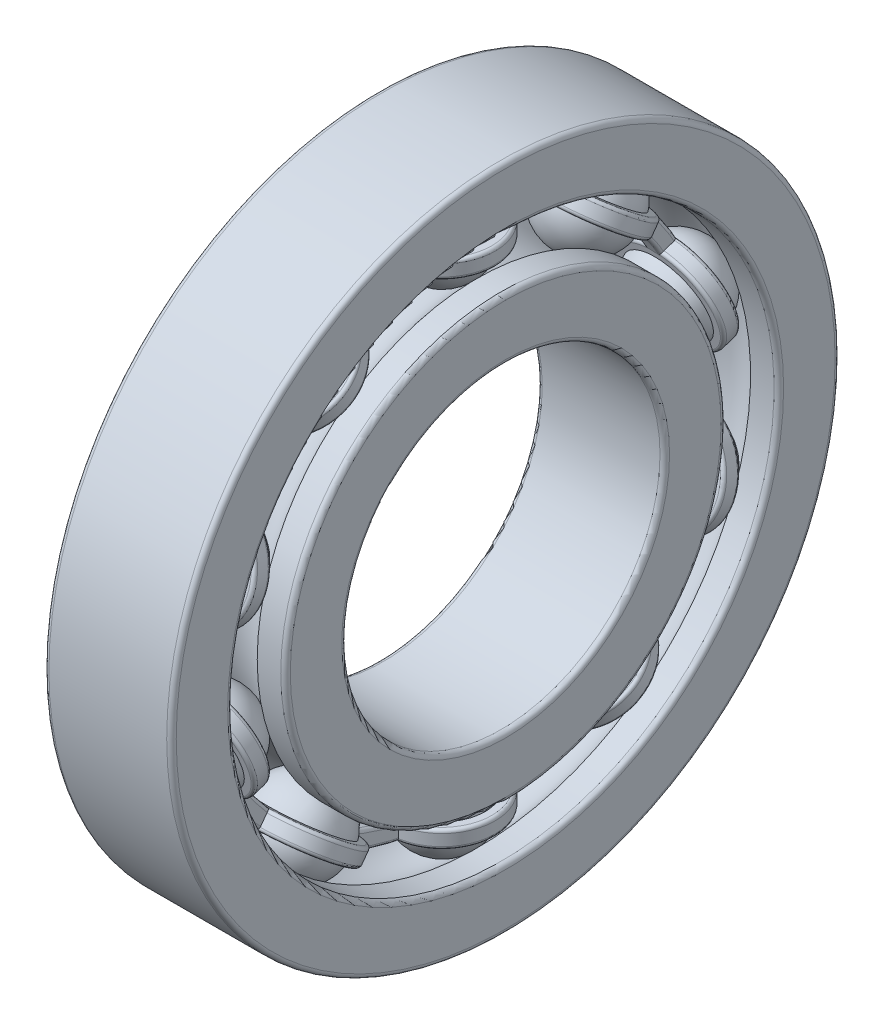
ISO-10303-21;
HEADER;
FILE_DESCRIPTION(('STEP AP214'),'2;1');
FILE_NAME('part.step','',(''),(''),'','','');
FILE_SCHEMA(('AUTOMOTIVE_DESIGN { 1 0 10303 214 1 1 1 1 }'));
ENDSEC;
DATA;
#1=APPLICATION_CONTEXT('core data for automotive mechanical design processes');
#2=APPLICATION_PROTOCOL_DEFINITION('international standard','automotive_design',2000,#1);
#3=PRODUCT_CONTEXT('',#1,'mechanical');
#4=PRODUCT('Part','Part','',(#3));
#5=PRODUCT_RELATED_PRODUCT_CATEGORY('part','',(#4));
#6=PRODUCT_DEFINITION_FORMATION('','',#4);
#7=PRODUCT_DEFINITION_CONTEXT('part definition',#1,'design');
#8=PRODUCT_DEFINITION('design','',#6,#7);
#9=PRODUCT_DEFINITION_SHAPE('','',#8);
#10=(LENGTH_UNIT() NAMED_UNIT(*) SI_UNIT(.MILLI.,.METRE.));
#11=(NAMED_UNIT(*) PLANE_ANGLE_UNIT() SI_UNIT($,.RADIAN.));
#12=(NAMED_UNIT(*) SI_UNIT($,.STERADIAN.) SOLID_ANGLE_UNIT());
#13=UNCERTAINTY_MEASURE_WITH_UNIT(LENGTH_MEASURE(1.E-05),#10,'distance_accuracy_value','');
#14=(GEOMETRIC_REPRESENTATION_CONTEXT(3) GLOBAL_UNCERTAINTY_ASSIGNED_CONTEXT((#13)) GLOBAL_UNIT_ASSIGNED_CONTEXT((#10,
#11,#12)) REPRESENTATION_CONTEXT('',''));
#15=CARTESIAN_POINT('',(0.,0.,0.));
#16=DIRECTION('',(0.,0.,1.));
#17=DIRECTION('',(1.,0.,0.));
#18=AXIS2_PLACEMENT_3D('',#15,#16,#17);
#19=CARTESIAN_POINT('',(0.,4.78976341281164,14.7413760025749));
#20=DIRECTION('',(1.,0.,0.));
#21=DIRECTION('',(0.,-0.309016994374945,-0.951056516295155));
#22=AXIS2_PLACEMENT_3D('',#19,#20,#21);
#23=SPHERICAL_SURFACE('',#22,2.778);
#24=CARTESIAN_POINT('',(-2.778,4.78976341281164,14.7413760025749));
#25=VERTEX_POINT('',#24);
#26=VERTEX_LOOP('',#25);
#27=FACE_BOUND('',#26,.T.);
#28=CARTESIAN_POINT('',(2.778,4.78976341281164,14.7413760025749));
#29=VERTEX_POINT('',#28);
#30=VERTEX_LOOP('',#29);
#31=FACE_BOUND('',#30,.T.);
#32=ADVANCED_FACE('P0_F16',(#27,#31),#23,.T.);
#33=CLOSED_SHELL('',(#32));
#34=MANIFOLD_SOLID_BREP('P0_B1',#33);
#35=CARTESIAN_POINT('',(0.,4.78976341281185,-14.7413760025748));
#36=DIRECTION('',(1.,0.,0.));
#37=DIRECTION('',(0.,-0.309016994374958,0.95105651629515));
#38=AXIS2_PLACEMENT_3D('',#35,#36,#37);
#39=SPHERICAL_SURFACE('',#38,2.778);
#40=CARTESIAN_POINT('',(2.778,4.78976341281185,-14.7413760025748));
#41=VERTEX_POINT('',#40);
#42=VERTEX_LOOP('',#41);
#43=FACE_BOUND('',#42,.T.);
#44=CARTESIAN_POINT('',(-2.778,4.78976341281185,-14.7413760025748));
#45=VERTEX_POINT('',#44);
#46=VERTEX_LOOP('',#45);
#47=FACE_BOUND('',#46,.T.);
#48=ADVANCED_FACE('P1_F16',(#43,#47),#39,.T.);
#49=CLOSED_SHELL('',(#48));
#50=MANIFOLD_SOLID_BREP('P1_B1',#49);
#51=CARTESIAN_POINT('',(0.,-12.8274498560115,9.31968784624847));
#52=DIRECTION('',(0.,-0.809016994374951,0.587785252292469));
#53=DIRECTION('',(0.,-0.587785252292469,-0.809016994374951));
#54=AXIS2_PLACEMENT_3D('',#51,#52,#53);
#55=TOROIDAL_SURFACE('',#54,3.1336,0.2);
#56=CARTESIAN_POINT('',(0.,-12.8274498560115,9.31968784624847));
#57=DIRECTION('',(0.,-0.809016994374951,0.587785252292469));
#58=DIRECTION('',(0.,-0.587785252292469,-0.809016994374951));
#59=AXIS2_PLACEMENT_3D('',#56,#57,#58);
#60=CIRCLE('',#59,3.3336);
#61=CARTESIAN_POINT('',(0.,-14.7868907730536,6.62274879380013));
#62=VERTEX_POINT('',#61);
#63=EDGE_CURVE('P2_E55',#62,#62,#60,.F.);
#64=ORIENTED_EDGE('',*,*,#63,.F.);
#65=EDGE_LOOP('',(#64));
#66=FACE_BOUND('',#65,.T.);
#67=CARTESIAN_POINT('',(0.,-12.9892532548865,9.43724489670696));
#68=DIRECTION('',(0.,0.809016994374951,-0.587785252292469));
#69=DIRECTION('',(0.,-0.587785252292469,-0.809016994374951));
#70=AXIS2_PLACEMENT_3D('',#67,#68,#69);
#71=CIRCLE('',#70,3.1336);
#72=CARTESIAN_POINT('',(0.,-11.1473693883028,11.9723805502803));
#73=VERTEX_POINT('',#72);
#74=CARTESIAN_POINT('',(0.,-14.8311371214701,6.90210924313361));
#75=VERTEX_POINT('',#74);
#76=EDGE_CURVE('P2_E47',#73,#75,#71,.F.);
#77=ORIENTED_EDGE('',*,*,#76,.F.);
#78=CARTESIAN_POINT('',(0.,-12.9892532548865,9.43724489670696));
#79=DIRECTION('',(0.,0.809016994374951,-0.587785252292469));
#80=DIRECTION('',(0.,0.587785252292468,0.809016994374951));
#81=AXIS2_PLACEMENT_3D('',#78,#79,#80);
#82=CIRCLE('',#81,3.1336);
#83=EDGE_CURVE('P2_E45',#75,#73,#82,.F.);
#84=ORIENTED_EDGE('',*,*,#83,.F.);
#85=EDGE_LOOP('',(#77,#84));
#86=FACE_BOUND('',#85,.T.);
#87=ADVANCED_FACE('P2_F17',(#66,#86),#55,.T.);
#88=CARTESIAN_POINT('',(0.,-14.7872126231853,10.7435388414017));
#89=DIRECTION('',(0.,-0.809016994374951,0.587785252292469));
#90=DIRECTION('',(0.,-0.587785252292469,-0.809016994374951));
#91=AXIS2_PLACEMENT_3D('',#88,#89,#90);
#92=CYLINDRICAL_SURFACE('',#91,3.3336);
#93=CARTESIAN_POINT('',(0.,-12.252076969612,8.90165497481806));
#94=DIRECTION('',(0.,0.809016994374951,-0.587785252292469));
#95=DIRECTION('',(0.,0.587785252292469,0.809016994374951));
#96=AXIS2_PLACEMENT_3D('',#93,#94,#95);
#97=CIRCLE('',#96,3.3336);
#98=CARTESIAN_POINT('',(0.,-10.2926360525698,11.5985940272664));
#99=VERTEX_POINT('',#98);
#100=EDGE_CURVE('P2_E51',#99,#99,#97,.T.);
#101=ORIENTED_EDGE('',*,*,#100,.F.);
#102=EDGE_LOOP('',(#101));
#103=FACE_BOUND('',#102,.T.);
#104=ORIENTED_EDGE('',*,*,#63,.T.);
#105=EDGE_LOOP('',(#104));
#106=FACE_BOUND('',#105,.T.);
#107=ADVANCED_FACE('P2_F73',(#103,#106),#92,.T.);
#108=CARTESIAN_POINT('',(-3.3336,-12.9892532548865,9.43724489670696));
#109=DIRECTION('',(0.,-0.809016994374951,0.587785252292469));
#110=DIRECTION('',(0.,-0.587785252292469,-0.809016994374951));
#111=AXIS2_PLACEMENT_3D('',#108,#109,#110);
#112=PLANE('',#111);
#113=CARTESIAN_POINT('',(0.,-12.9892532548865,9.43724489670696));
#114=DIRECTION('',(0.,-0.809016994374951,0.587785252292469));
#115=DIRECTION('',(0.,-0.587785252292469,-0.809016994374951));
#116=AXIS2_PLACEMENT_3D('',#113,#114,#115);
#117=CIRCLE('',#116,2.2224);
#118=CARTESIAN_POINT('',(0.,-14.2955471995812,7.63928552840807));
#119=VERTEX_POINT('',#118);
#120=EDGE_CURVE('P2_E88',#119,#119,#117,.F.);
#121=ORIENTED_EDGE('',*,*,#120,.T.);
#122=EDGE_LOOP('',(#121));
#123=FACE_BOUND('',#122,.T.);
#124=ORIENTED_EDGE('',*,*,#83,.T.);
#125=ORIENTED_EDGE('',*,*,#76,.T.);
#126=EDGE_LOOP('',(#124,#125));
#127=FACE_BOUND('',#126,.T.);
#128=ADVANCED_FACE('P2_F54',(#123,#127),#112,.T.);
#129=CARTESIAN_POINT('',(0.,-12.252076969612,8.90165497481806));
#130=DIRECTION('',(0.,0.809016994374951,-0.587785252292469));
#131=DIRECTION('',(0.,0.587785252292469,0.809016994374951));
#132=AXIS2_PLACEMENT_3D('',#129,#130,#131);
#133=TOROIDAL_SURFACE('',#132,3.1336,0.2);
#134=ORIENTED_EDGE('',*,*,#100,.T.);
#135=EDGE_LOOP('',(#134));
#136=FACE_BOUND('',#135,.T.);
#137=CARTESIAN_POINT('',(0.,-12.090273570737,8.78409792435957));
#138=DIRECTION('',(0.,-0.809016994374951,0.587785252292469));
#139=DIRECTION('',(0.,0.587785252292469,0.809016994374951));
#140=AXIS2_PLACEMENT_3D('',#137,#138,#139);
#141=CIRCLE('',#140,3.1336);
#142=CARTESIAN_POINT('',(0.,-13.9321574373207,6.24896227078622));
#143=VERTEX_POINT('',#142);
#144=CARTESIAN_POINT('',(0.,-10.2483897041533,11.3192335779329));
#145=VERTEX_POINT('',#144);
#146=EDGE_CURVE('P2_E29',#143,#145,#141,.F.);
#147=ORIENTED_EDGE('',*,*,#146,.F.);
#148=CARTESIAN_POINT('',(0.,-12.090273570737,8.78409792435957));
#149=DIRECTION('',(0.,-0.809016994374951,0.587785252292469));
#150=DIRECTION('',(0.,-0.587785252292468,-0.809016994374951));
#151=AXIS2_PLACEMENT_3D('',#148,#149,#150);
#152=CIRCLE('',#151,3.1336);
#153=EDGE_CURVE('P2_E93',#145,#143,#152,.F.);
#154=ORIENTED_EDGE('',*,*,#153,.F.);
#155=EDGE_LOOP('',(#147,#154));
#156=FACE_BOUND('',#155,.T.);
#157=ADVANCED_FACE('P2_F72',(#136,#156),#133,.T.);
#158=CARTESIAN_POINT('',(0.,-14.7872126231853,10.7435388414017));
#159=DIRECTION('',(0.,-0.809016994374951,0.587785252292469));
#160=DIRECTION('',(0.,-0.587785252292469,-0.809016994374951));
#161=AXIS2_PLACEMENT_3D('',#158,#159,#160);
#162=CYLINDRICAL_SURFACE('',#161,2.2224);
#163=ORIENTED_EDGE('',*,*,#120,.F.);
#164=EDGE_LOOP('',(#163));
#165=FACE_BOUND('',#164,.T.);
#166=CARTESIAN_POINT('',(0.,-12.090273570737,8.78409792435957));
#167=DIRECTION('',(0.,-0.809016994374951,0.587785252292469));
#168=DIRECTION('',(0.,-0.587785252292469,-0.809016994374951));
#169=AXIS2_PLACEMENT_3D('',#166,#167,#168);
#170=CIRCLE('',#169,2.2224);
#171=CARTESIAN_POINT('',(0.,-13.3965675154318,6.98613855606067));
#172=VERTEX_POINT('',#171);
#173=EDGE_CURVE('P2_E11',#172,#172,#170,.T.);
#174=ORIENTED_EDGE('',*,*,#173,.F.);
#175=EDGE_LOOP('',(#174));
#176=FACE_BOUND('',#175,.T.);
#177=ADVANCED_FACE('P2_F125',(#165,#176),#162,.F.);
#178=CARTESIAN_POINT('',(-3.3336,-12.090273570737,8.78409792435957));
#179=DIRECTION('',(0.,0.809016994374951,-0.587785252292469));
#180=DIRECTION('',(0.,0.587785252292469,0.809016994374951));
#181=AXIS2_PLACEMENT_3D('',#178,#179,#180);
#182=PLANE('',#181);
#183=ORIENTED_EDGE('',*,*,#173,.T.);
#184=EDGE_LOOP('',(#183));
#185=FACE_BOUND('',#184,.T.);
#186=ORIENTED_EDGE('',*,*,#153,.T.);
#187=ORIENTED_EDGE('',*,*,#146,.T.);
#188=EDGE_LOOP('',(#186,#187));
#189=FACE_BOUND('',#188,.T.);
#190=ADVANCED_FACE('P2_F109',(#185,#189),#182,.T.);
#191=CLOSED_SHELL('',(#87,#107,#128,#157,#177,#190));
#192=MANIFOLD_SOLID_BREP('P2_B1',#191);
#193=CARTESIAN_POINT('',(0.,-4.67987696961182,-14.4031803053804));
#194=DIRECTION('',(0.,0.309016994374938,0.951056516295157));
#195=DIRECTION('',(0.,-0.951056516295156,0.309016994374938));
#196=AXIS2_PLACEMENT_3D('',#193,#194,#195);
#197=TOROIDAL_SURFACE('',#196,3.1336,0.2);
#198=CARTESIAN_POINT('',(0.,-4.67987696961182,-14.4031803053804));
#199=DIRECTION('',(0.,-0.309016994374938,-0.951056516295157));
#200=DIRECTION('',(0.,0.951056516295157,-0.309016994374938));
#201=AXIS2_PLACEMENT_3D('',#198,#199,#200);
#202=CIRCLE('',#201,3.3336);
#203=CARTESIAN_POINT('',(0.,-1.50943496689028,-15.4333193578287));
#204=VERTEX_POINT('',#203);
#205=EDGE_CURVE('P3_E55',#204,#204,#202,.T.);
#206=ORIENTED_EDGE('',*,*,#205,.F.);
#207=EDGE_LOOP('',(#206));
#208=FACE_BOUND('',#207,.T.);
#209=CARTESIAN_POINT('',(0.,-4.61807357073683,-14.2129690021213));
#210=DIRECTION('',(0.,-0.309016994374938,-0.951056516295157));
#211=DIRECTION('',(0.,-0.951056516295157,0.309016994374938));
#212=AXIS2_PLACEMENT_3D('',#209,#210,#211);
#213=CIRCLE('',#212,3.1336);
#214=CARTESIAN_POINT('',(0.,-1.63784287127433,-15.1813046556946));
#215=VERTEX_POINT('',#214);
#216=CARTESIAN_POINT('',(0.,-7.59830427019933,-13.244633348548));
#217=VERTEX_POINT('',#216);
#218=EDGE_CURVE('P3_E47',#215,#217,#213,.F.);
#219=ORIENTED_EDGE('',*,*,#218,.F.);
#220=CARTESIAN_POINT('',(0.,-4.61807357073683,-14.2129690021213));
#221=DIRECTION('',(0.,-0.309016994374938,-0.951056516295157));
#222=DIRECTION('',(0.,0.951056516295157,-0.309016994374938));
#223=AXIS2_PLACEMENT_3D('',#220,#221,#222);
#224=CIRCLE('',#223,3.1336);
#225=EDGE_CURVE('P3_E45',#217,#215,#224,.F.);
#226=ORIENTED_EDGE('',*,*,#225,.F.);
#227=EDGE_LOOP('',(#219,#226));
#228=FACE_BOUND('',#227,.T.);
#229=ADVANCED_FACE('P3_F17',(#208,#228),#197,.T.);
#230=CARTESIAN_POINT('',(0.,-5.64821262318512,-17.3834110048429));
#231=DIRECTION('',(0.,-0.309016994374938,-0.951056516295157));
#232=DIRECTION('',(0.,0.951056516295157,-0.309016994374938));
#233=AXIS2_PLACEMENT_3D('',#230,#231,#232);
#234=CYLINDRICAL_SURFACE('',#233,3.3336);
#235=ORIENTED_EDGE('',*,*,#205,.T.);
#236=EDGE_LOOP('',(#235));
#237=FACE_BOUND('',#236,.T.);
#238=CARTESIAN_POINT('',(0.,-4.89964985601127,-15.0795716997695));
#239=DIRECTION('',(0.,-0.309016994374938,-0.951056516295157));
#240=DIRECTION('',(0.,0.951056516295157,-0.309016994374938));
#241=AXIS2_PLACEMENT_3D('',#238,#239,#240);
#242=CIRCLE('',#241,3.3336);
#243=CARTESIAN_POINT('',(0.,-1.72920785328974,-16.1097107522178));
#244=VERTEX_POINT('',#243);
#245=EDGE_CURVE('P3_E51',#244,#244,#242,.T.);
#246=ORIENTED_EDGE('',*,*,#245,.F.);
#247=EDGE_LOOP('',(#246));
#248=FACE_BOUND('',#247,.T.);
#249=ADVANCED_FACE('P3_F73',(#237,#248),#234,.T.);
#250=CARTESIAN_POINT('',(-3.3336,-4.61807357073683,-14.2129690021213));
#251=DIRECTION('',(0.,0.309016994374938,0.951056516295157));
#252=DIRECTION('',(0.,-0.951056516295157,0.309016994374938));
#253=AXIS2_PLACEMENT_3D('',#250,#251,#252);
#254=PLANE('',#253);
#255=CARTESIAN_POINT('',(0.,-4.61807357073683,-14.2129690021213));
#256=DIRECTION('',(0.,-0.309016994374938,-0.951056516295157));
#257=DIRECTION('',(0.,0.951056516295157,-0.309016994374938));
#258=AXIS2_PLACEMENT_3D('',#255,#256,#257);
#259=CIRCLE('',#258,2.2224);
#260=CARTESIAN_POINT('',(0.,-2.50444556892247,-14.8997283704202));
#261=VERTEX_POINT('',#260);
#262=EDGE_CURVE('P3_E88',#261,#261,#259,.T.);
#263=ORIENTED_EDGE('',*,*,#262,.T.);
#264=EDGE_LOOP('',(#263));
#265=FACE_BOUND('',#264,.T.);
#266=ORIENTED_EDGE('',*,*,#225,.T.);
#267=ORIENTED_EDGE('',*,*,#218,.T.);
#268=EDGE_LOOP('',(#266,#267));
#269=FACE_BOUND('',#268,.T.);
#270=ADVANCED_FACE('P3_F54',(#265,#269),#254,.T.);
#271=CARTESIAN_POINT('',(0.,-4.89964985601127,-15.0795716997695));
#272=DIRECTION('',(0.,-0.309016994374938,-0.951056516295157));
#273=DIRECTION('',(0.,0.951056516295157,-0.309016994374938));
#274=AXIS2_PLACEMENT_3D('',#271,#272,#273);
#275=TOROIDAL_SURFACE('',#274,3.1336,0.2);
#276=ORIENTED_EDGE('',*,*,#245,.T.);
#277=EDGE_LOOP('',(#276));
#278=FACE_BOUND('',#277,.T.);
#279=CARTESIAN_POINT('',(0.,-4.96145325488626,-15.2697830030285));
#280=DIRECTION('',(0.,0.309016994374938,0.951056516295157));
#281=DIRECTION('',(0.,0.951056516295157,-0.309016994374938));
#282=AXIS2_PLACEMENT_3D('',#279,#280,#281);
#283=CIRCLE('',#282,3.1336);
#284=CARTESIAN_POINT('',(0.,-7.94168395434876,-14.3014473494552));
#285=VERTEX_POINT('',#284);
#286=CARTESIAN_POINT('',(0.,-1.98122255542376,-16.2381186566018));
#287=VERTEX_POINT('',#286);
#288=EDGE_CURVE('P3_E29',#285,#287,#283,.F.);
#289=ORIENTED_EDGE('',*,*,#288,.F.);
#290=CARTESIAN_POINT('',(0.,-4.96145325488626,-15.2697830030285));
#291=DIRECTION('',(0.,0.309016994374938,0.951056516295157));
#292=DIRECTION('',(0.,-0.951056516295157,0.309016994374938));
#293=AXIS2_PLACEMENT_3D('',#290,#291,#292);
#294=CIRCLE('',#293,3.1336);
#295=EDGE_CURVE('P3_E93',#287,#285,#294,.F.);
#296=ORIENTED_EDGE('',*,*,#295,.F.);
#297=EDGE_LOOP('',(#289,#296));
#298=FACE_BOUND('',#297,.T.);
#299=ADVANCED_FACE('P3_F72',(#278,#298),#275,.T.);
#300=CARTESIAN_POINT('',(0.,-5.64821262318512,-17.3834110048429));
#301=DIRECTION('',(0.,-0.309016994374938,-0.951056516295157));
#302=DIRECTION('',(0.,0.951056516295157,-0.309016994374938));
#303=AXIS2_PLACEMENT_3D('',#300,#301,#302);
#304=CYLINDRICAL_SURFACE('',#303,2.2224);
#305=CARTESIAN_POINT('',(0.,-4.96145325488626,-15.2697830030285));
#306=DIRECTION('',(0.,-0.309016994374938,-0.951056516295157));
#307=DIRECTION('',(0.,0.951056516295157,-0.309016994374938));
#308=AXIS2_PLACEMENT_3D('',#305,#306,#307);
#309=CIRCLE('',#308,2.2224);
#310=CARTESIAN_POINT('',(0.,-2.8478252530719,-15.9565423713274));
#311=VERTEX_POINT('',#310);
#312=EDGE_CURVE('P3_E11',#311,#311,#309,.F.);
#313=ORIENTED_EDGE('',*,*,#312,.F.);
#314=EDGE_LOOP('',(#313));
#315=FACE_BOUND('',#314,.T.);
#316=ORIENTED_EDGE('',*,*,#262,.F.);
#317=EDGE_LOOP('',(#316));
#318=FACE_BOUND('',#317,.T.);
#319=ADVANCED_FACE('P3_F125',(#315,#318),#304,.F.);
#320=CARTESIAN_POINT('',(-3.3336,-4.96145325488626,-15.2697830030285));
#321=DIRECTION('',(0.,-0.309016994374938,-0.951056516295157));
#322=DIRECTION('',(0.,0.951056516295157,-0.309016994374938));
#323=AXIS2_PLACEMENT_3D('',#320,#321,#322);
#324=PLANE('',#323);
#325=ORIENTED_EDGE('',*,*,#312,.T.);
#326=EDGE_LOOP('',(#325));
#327=FACE_BOUND('',#326,.T.);
#328=ORIENTED_EDGE('',*,*,#295,.T.);
#329=ORIENTED_EDGE('',*,*,#288,.T.);
#330=EDGE_LOOP('',(#328,#329));
#331=FACE_BOUND('',#330,.T.);
#332=ADVANCED_FACE('P3_F109',(#327,#331),#324,.T.);
#333=CLOSED_SHELL('',(#229,#249,#270,#299,#319,#332));
#334=MANIFOLD_SOLID_BREP('P3_B1',#333);
#335=CARTESIAN_POINT('',(0.,0.,0.));
#336=DIRECTION('',(-1.,0.,0.));
#337=DIRECTION('',(0.,0.,1.));
#338=AXIS2_PLACEMENT_3D('',#335,#336,#337);
#339=TOROIDAL_SURFACE('',#338,15.5,2.778);
#340=CARTESIAN_POINT('',(2.2224,0.,0.));
#341=DIRECTION('',(-1.,0.,0.));
#342=DIRECTION('',(0.,0.,1.));
#343=AXIS2_PLACEMENT_3D('',#340,#341,#342);
#344=CIRCLE('',#343,17.1668);
#345=CARTESIAN_POINT('',(2.2224,0.,17.1668));
#346=VERTEX_POINT('',#345);
#347=EDGE_CURVE('P4_E288',#346,#346,#344,.F.);
#348=ORIENTED_EDGE('',*,*,#347,.T.);
#349=EDGE_LOOP('',(#348));
#350=FACE_BOUND('',#349,.T.);
#351=CARTESIAN_POINT('',(-2.2224,0.,0.));
#352=DIRECTION('',(-1.,0.,0.));
#353=DIRECTION('',(0.,0.,1.));
#354=AXIS2_PLACEMENT_3D('',#351,#352,#353);
#355=CIRCLE('',#354,17.1668);
#356=CARTESIAN_POINT('',(-2.2224,0.,17.1668));
#357=VERTEX_POINT('',#356);
#358=EDGE_CURVE('P4_E291',#357,#357,#355,.T.);
#359=ORIENTED_EDGE('',*,*,#358,.T.);
#360=EDGE_LOOP('',(#359));
#361=FACE_BOUND('',#360,.T.);
#362=ADVANCED_FACE('P4_F17',(#350,#361),#339,.F.);
#363=CARTESIAN_POINT('',(0.,0.,0.));
#364=DIRECTION('',(-1.,0.,0.));
#365=DIRECTION('',(0.,0.,1.));
#366=AXIS2_PLACEMENT_3D('',#363,#364,#365);
#367=CYLINDRICAL_SURFACE('',#366,17.1668);
#368=CARTESIAN_POINT('',(3.7,0.,0.));
#369=DIRECTION('',(-1.,0.,0.));
#370=DIRECTION('',(0.,0.,1.));
#371=AXIS2_PLACEMENT_3D('',#368,#369,#370);
#372=CIRCLE('',#371,17.1668);
#373=CARTESIAN_POINT('',(3.7,0.,17.1668));
#374=VERTEX_POINT('',#373);
#375=EDGE_CURVE('P4_E292',#374,#374,#372,.T.);
#376=ORIENTED_EDGE('',*,*,#375,.F.);
#377=EDGE_LOOP('',(#376));
#378=FACE_BOUND('',#377,.T.);
#379=ORIENTED_EDGE('',*,*,#347,.F.);
#380=EDGE_LOOP('',(#379));
#381=FACE_BOUND('',#380,.T.);
#382=ADVANCED_FACE('P4_F242',(#378,#381),#367,.F.);
#383=CARTESIAN_POINT('',(0.,0.,0.));
#384=DIRECTION('',(-1.,0.,0.));
#385=DIRECTION('',(0.,0.,1.));
#386=AXIS2_PLACEMENT_3D('',#383,#384,#385);
#387=CYLINDRICAL_SURFACE('',#386,17.1668);
#388=ORIENTED_EDGE('',*,*,#358,.F.);
#389=EDGE_LOOP('',(#388));
#390=FACE_BOUND('',#389,.T.);
#391=CARTESIAN_POINT('',(-3.7,0.,0.));
#392=DIRECTION('',(-1.,0.,0.));
#393=DIRECTION('',(0.,0.,1.));
#394=AXIS2_PLACEMENT_3D('',#391,#392,#393);
#395=CIRCLE('',#394,17.1668);
#396=CARTESIAN_POINT('',(-3.7,0.,17.1668));
#397=VERTEX_POINT('',#396);
#398=EDGE_CURVE('P4_E66',#397,#397,#395,.F.);
#399=ORIENTED_EDGE('',*,*,#398,.F.);
#400=EDGE_LOOP('',(#399));
#401=FACE_BOUND('',#400,.T.);
#402=ADVANCED_FACE('P4_F236',(#390,#401),#387,.F.);
#403=CARTESIAN_POINT('',(3.7,0.,0.));
#404=DIRECTION('',(-1.,0.,0.));
#405=DIRECTION('',(0.,0.,1.));
#406=AXIS2_PLACEMENT_3D('',#403,#404,#405);
#407=TOROIDAL_SURFACE('',#406,17.4668,0.300000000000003);
#408=CARTESIAN_POINT('',(4.,0.,0.));
#409=DIRECTION('',(1.,0.,0.));
#410=DIRECTION('',(0.,0.,1.));
#411=AXIS2_PLACEMENT_3D('',#408,#409,#410);
#412=CIRCLE('',#411,17.4668);
#413=CARTESIAN_POINT('',(4.,0.,17.4668));
#414=VERTEX_POINT('',#413);
#415=CARTESIAN_POINT('',(4.,0.,-17.4668));
#416=VERTEX_POINT('',#415);
#417=EDGE_CURVE('P4_E61',#414,#416,#412,.T.);
#418=ORIENTED_EDGE('',*,*,#417,.T.);
#419=CARTESIAN_POINT('',(4.,0.,0.));
#420=DIRECTION('',(1.,0.,0.));
#421=DIRECTION('',(0.,0.,-1.));
#422=AXIS2_PLACEMENT_3D('',#419,#420,#421);
#423=CIRCLE('',#422,17.4668);
#424=EDGE_CURVE('P4_E58',#416,#414,#423,.T.);
#425=ORIENTED_EDGE('',*,*,#424,.T.);
#426=EDGE_LOOP('',(#418,#425));
#427=FACE_BOUND('',#426,.T.);
#428=ORIENTED_EDGE('',*,*,#375,.T.);
#429=EDGE_LOOP('',(#428));
#430=FACE_BOUND('',#429,.T.);
#431=ADVANCED_FACE('P4_F62',(#427,#430),#407,.T.);
#432=CARTESIAN_POINT('',(-3.7,0.,0.));
#433=DIRECTION('',(-1.,0.,0.));
#434=DIRECTION('',(0.,0.,1.));
#435=AXIS2_PLACEMENT_3D('',#432,#433,#434);
#436=TOROIDAL_SURFACE('',#435,17.4668,0.300000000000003);
#437=ORIENTED_EDGE('',*,*,#398,.T.);
#438=EDGE_LOOP('',(#437));
#439=FACE_BOUND('',#438,.T.);
#440=CARTESIAN_POINT('',(-4.,0.,0.));
#441=DIRECTION('',(-1.,0.,0.));
#442=DIRECTION('',(0.,0.,1.));
#443=AXIS2_PLACEMENT_3D('',#440,#441,#442);
#444=CIRCLE('',#443,17.4668);
#445=CARTESIAN_POINT('',(-4.,0.,17.4668));
#446=VERTEX_POINT('',#445);
#447=CARTESIAN_POINT('',(-4.,0.,-17.4668));
#448=VERTEX_POINT('',#447);
#449=EDGE_CURVE('P4_E120',#446,#448,#444,.T.);
#450=ORIENTED_EDGE('',*,*,#449,.T.);
#451=CARTESIAN_POINT('',(-4.,0.,0.));
#452=DIRECTION('',(-1.,0.,0.));
#453=DIRECTION('',(0.,0.,-1.));
#454=AXIS2_PLACEMENT_3D('',#451,#452,#453);
#455=CIRCLE('',#454,17.4668);
#456=EDGE_CURVE('P4_E71',#448,#446,#455,.T.);
#457=ORIENTED_EDGE('',*,*,#456,.T.);
#458=EDGE_LOOP('',(#450,#457));
#459=FACE_BOUND('',#458,.T.);
#460=ADVANCED_FACE('P4_F92',(#439,#459),#436,.T.);
#461=CARTESIAN_POINT('',(4.,17.4668,0.));
#462=DIRECTION('',(-1.,0.,0.));
#463=DIRECTION('',(0.,0.,1.));
#464=AXIS2_PLACEMENT_3D('',#461,#462,#463);
#465=PLANE('',#464);
#466=ORIENTED_EDGE('',*,*,#417,.F.);
#467=ORIENTED_EDGE('',*,*,#424,.F.);
#468=EDGE_LOOP('',(#466,#467));
#469=FACE_BOUND('',#468,.T.);
#470=CARTESIAN_POINT('',(4.,0.,0.));
#471=DIRECTION('',(-1.,0.,0.));
#472=DIRECTION('',(0.,0.,-1.));
#473=AXIS2_PLACEMENT_3D('',#470,#471,#472);
#474=CIRCLE('',#473,20.7);
#475=CARTESIAN_POINT('',(4.,0.,-20.7));
#476=VERTEX_POINT('',#475);
#477=CARTESIAN_POINT('',(4.,0.,20.7));
#478=VERTEX_POINT('',#477);
#479=EDGE_CURVE('P4_E115',#476,#478,#474,.T.);
#480=ORIENTED_EDGE('',*,*,#479,.F.);
#481=CARTESIAN_POINT('',(4.,0.,0.));
#482=DIRECTION('',(-1.,0.,0.));
#483=DIRECTION('',(0.,0.,1.));
#484=AXIS2_PLACEMENT_3D('',#481,#482,#483);
#485=CIRCLE('',#484,20.7);
#486=EDGE_CURVE('P4_E113',#478,#476,#485,.T.);
#487=ORIENTED_EDGE('',*,*,#486,.F.);
#488=EDGE_LOOP('',(#480,#487));
#489=FACE_BOUND('',#488,.T.);
#490=ADVANCED_FACE('P4_F69',(#469,#489),#465,.F.);
#491=CARTESIAN_POINT('',(-4.,17.4668,0.));
#492=DIRECTION('',(1.,0.,0.));
#493=DIRECTION('',(0.,0.,-1.));
#494=AXIS2_PLACEMENT_3D('',#491,#492,#493);
#495=PLANE('',#494);
#496=CARTESIAN_POINT('',(-4.,0.,0.));
#497=DIRECTION('',(1.,0.,0.));
#498=DIRECTION('',(0.,0.,1.));
#499=AXIS2_PLACEMENT_3D('',#496,#497,#498);
#500=CIRCLE('',#499,20.7);
#501=CARTESIAN_POINT('',(-4.,0.,20.7));
#502=VERTEX_POINT('',#501);
#503=CARTESIAN_POINT('',(-4.,0.,-20.7));
#504=VERTEX_POINT('',#503);
#505=EDGE_CURVE('P4_E37',#502,#504,#500,.T.);
#506=ORIENTED_EDGE('',*,*,#505,.F.);
#507=CARTESIAN_POINT('',(-4.,0.,0.));
#508=DIRECTION('',(1.,0.,0.));
#509=DIRECTION('',(0.,0.,-1.));
#510=AXIS2_PLACEMENT_3D('',#507,#508,#509);
#511=CIRCLE('',#510,20.7);
#512=EDGE_CURVE('P4_E117',#504,#502,#511,.T.);
#513=ORIENTED_EDGE('',*,*,#512,.F.);
#514=EDGE_LOOP('',(#506,#513));
#515=FACE_BOUND('',#514,.T.);
#516=ORIENTED_EDGE('',*,*,#456,.F.);
#517=ORIENTED_EDGE('',*,*,#449,.F.);
#518=EDGE_LOOP('',(#516,#517));
#519=FACE_BOUND('',#518,.T.);
#520=ADVANCED_FACE('P4_F91',(#515,#519),#495,.F.);
#521=CARTESIAN_POINT('',(3.7,0.,0.));
#522=DIRECTION('',(-1.,0.,0.));
#523=DIRECTION('',(0.,0.,1.));
#524=AXIS2_PLACEMENT_3D('',#521,#522,#523);
#525=TOROIDAL_SURFACE('',#524,20.7,0.299999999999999);
#526=CARTESIAN_POINT('',(3.7,0.,0.));
#527=DIRECTION('',(-1.,0.,0.));
#528=DIRECTION('',(0.,0.,1.));
#529=AXIS2_PLACEMENT_3D('',#526,#527,#528);
#530=CIRCLE('',#529,21.);
#531=CARTESIAN_POINT('',(3.7,0.,21.));
#532=VERTEX_POINT('',#531);
#533=EDGE_CURVE('P4_E29',#532,#532,#530,.T.);
#534=ORIENTED_EDGE('',*,*,#533,.F.);
#535=EDGE_LOOP('',(#534));
#536=FACE_BOUND('',#535,.T.);
#537=ORIENTED_EDGE('',*,*,#486,.T.);
#538=ORIENTED_EDGE('',*,*,#479,.T.);
#539=EDGE_LOOP('',(#537,#538));
#540=FACE_BOUND('',#539,.T.);
#541=ADVANCED_FACE('P4_F119',(#536,#540),#525,.T.);
#542=CARTESIAN_POINT('',(-3.7,0.,0.));
#543=DIRECTION('',(-1.,0.,0.));
#544=DIRECTION('',(0.,0.,1.));
#545=AXIS2_PLACEMENT_3D('',#542,#543,#544);
#546=TOROIDAL_SURFACE('',#545,20.7,0.299999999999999);
#547=ORIENTED_EDGE('',*,*,#505,.T.);
#548=ORIENTED_EDGE('',*,*,#512,.T.);
#549=EDGE_LOOP('',(#547,#548));
#550=FACE_BOUND('',#549,.T.);
#551=CARTESIAN_POINT('',(-3.7,0.,0.));
#552=DIRECTION('',(-1.,0.,0.));
#553=DIRECTION('',(0.,0.,1.));
#554=AXIS2_PLACEMENT_3D('',#551,#552,#553);
#555=CIRCLE('',#554,21.);
#556=CARTESIAN_POINT('',(-3.7,0.,21.));
#557=VERTEX_POINT('',#556);
#558=EDGE_CURVE('P4_E11',#557,#557,#555,.F.);
#559=ORIENTED_EDGE('',*,*,#558,.F.);
#560=EDGE_LOOP('',(#559));
#561=FACE_BOUND('',#560,.T.);
#562=ADVANCED_FACE('P4_F138',(#550,#561),#546,.T.);
#563=CARTESIAN_POINT('',(0.,0.,0.));
#564=DIRECTION('',(-1.,0.,0.));
#565=DIRECTION('',(0.,0.,1.));
#566=AXIS2_PLACEMENT_3D('',#563,#564,#565);
#567=CYLINDRICAL_SURFACE('',#566,21.);
#568=ORIENTED_EDGE('',*,*,#558,.T.);
#569=EDGE_LOOP('',(#568));
#570=FACE_BOUND('',#569,.T.);
#571=ORIENTED_EDGE('',*,*,#533,.T.);
#572=EDGE_LOOP('',(#571));
#573=FACE_BOUND('',#572,.T.);
#574=ADVANCED_FACE('P4_F199',(#570,#573),#567,.T.);
#575=CLOSED_SHELL('',(#362,#382,#402,#431,#460,#490,#520,#541,#562,#574));
#576=MANIFOLD_SOLID_BREP('P4_B1',#575);
#577=CARTESIAN_POINT('',(0.,0.,0.));
#578=DIRECTION('',(-1.,0.,0.));
#579=DIRECTION('',(0.,0.,1.));
#580=AXIS2_PLACEMENT_3D('',#577,#578,#579);
#581=CYLINDRICAL_SURFACE('',#580,13.8332);
#582=CARTESIAN_POINT('',(-3.7,0.,0.));
#583=DIRECTION('',(-1.,0.,0.));
#584=DIRECTION('',(0.,0.,1.));
#585=AXIS2_PLACEMENT_3D('',#582,#583,#584);
#586=CIRCLE('',#585,13.8332);
#587=CARTESIAN_POINT('',(-3.7,0.,13.8332));
#588=VERTEX_POINT('',#587);
#589=EDGE_CURVE('P5_E164',#588,#588,#586,.T.);
#590=ORIENTED_EDGE('',*,*,#589,.F.);
#591=EDGE_LOOP('',(#590));
#592=FACE_BOUND('',#591,.T.);
#593=CARTESIAN_POINT('',(-2.2224,0.,0.));
#594=DIRECTION('',(-1.,0.,0.));
#595=DIRECTION('',(0.,0.,1.));
#596=AXIS2_PLACEMENT_3D('',#593,#594,#595);
#597=CIRCLE('',#596,13.8332);
#598=CARTESIAN_POINT('',(-2.2224,0.,13.8332));
#599=VERTEX_POINT('',#598);
#600=EDGE_CURVE('P5_E67',#599,#599,#597,.T.);
#601=ORIENTED_EDGE('',*,*,#600,.T.);
#602=EDGE_LOOP('',(#601));
#603=FACE_BOUND('',#602,.T.);
#604=ADVANCED_FACE('P5_F17',(#592,#603),#581,.T.);
#605=CARTESIAN_POINT('',(-3.7,0.,0.));
#606=DIRECTION('',(-1.,0.,0.));
#607=DIRECTION('',(0.,0.,1.));
#608=AXIS2_PLACEMENT_3D('',#605,#606,#607);
#609=TOROIDAL_SURFACE('',#608,13.5332,0.3);
#610=CARTESIAN_POINT('',(-4.,0.,0.));
#611=DIRECTION('',(1.,0.,0.));
#612=DIRECTION('',(0.,0.,1.));
#613=AXIS2_PLACEMENT_3D('',#610,#611,#612);
#614=CIRCLE('',#613,13.5332);
#615=CARTESIAN_POINT('',(-4.,0.,13.5332));
#616=VERTEX_POINT('',#615);
#617=CARTESIAN_POINT('',(-4.,0.,-13.5332));
#618=VERTEX_POINT('',#617);
#619=EDGE_CURVE('P5_E53',#616,#618,#614,.T.);
#620=ORIENTED_EDGE('',*,*,#619,.T.);
#621=CARTESIAN_POINT('',(-4.,0.,0.));
#622=DIRECTION('',(1.,0.,0.));
#623=DIRECTION('',(0.,0.,-1.));
#624=AXIS2_PLACEMENT_3D('',#621,#622,#623);
#625=CIRCLE('',#624,13.5332);
#626=EDGE_CURVE('P5_E56',#618,#616,#625,.T.);
#627=ORIENTED_EDGE('',*,*,#626,.T.);
#628=EDGE_LOOP('',(#620,#627));
#629=FACE_BOUND('',#628,.T.);
#630=ORIENTED_EDGE('',*,*,#589,.T.);
#631=EDGE_LOOP('',(#630));
#632=FACE_BOUND('',#631,.T.);
#633=ADVANCED_FACE('P5_F65',(#629,#632),#609,.T.);
#634=CARTESIAN_POINT('',(-4.,13.5332,0.));
#635=DIRECTION('',(1.,0.,0.));
#636=DIRECTION('',(0.,0.,-1.));
#637=AXIS2_PLACEMENT_3D('',#634,#635,#636);
#638=PLANE('',#637);
#639=ORIENTED_EDGE('',*,*,#619,.F.);
#640=ORIENTED_EDGE('',*,*,#626,.F.);
#641=EDGE_LOOP('',(#639,#640));
#642=FACE_BOUND('',#641,.T.);
#643=CARTESIAN_POINT('',(-4.,0.,0.));
#644=DIRECTION('',(-1.,0.,0.));
#645=DIRECTION('',(0.,0.,-1.));
#646=AXIS2_PLACEMENT_3D('',#643,#644,#645);
#647=CIRCLE('',#646,10.3);
#648=CARTESIAN_POINT('',(-4.,0.,-10.3));
#649=VERTEX_POINT('',#648);
#650=CARTESIAN_POINT('',(-4.,0.,10.3));
#651=VERTEX_POINT('',#650);
#652=EDGE_CURVE('P5_E62',#649,#651,#647,.T.);
#653=ORIENTED_EDGE('',*,*,#652,.F.);
#654=CARTESIAN_POINT('',(-4.,0.,0.));
#655=DIRECTION('',(-1.,0.,0.));
#656=DIRECTION('',(0.,0.,1.));
#657=AXIS2_PLACEMENT_3D('',#654,#655,#656);
#658=CIRCLE('',#657,10.3);
#659=EDGE_CURVE('P5_E100',#651,#649,#658,.T.);
#660=ORIENTED_EDGE('',*,*,#659,.F.);
#661=EDGE_LOOP('',(#653,#660));
#662=FACE_BOUND('',#661,.T.);
#663=ADVANCED_FACE('P5_F58',(#642,#662),#638,.F.);
#664=CARTESIAN_POINT('',(0.,0.,0.));
#665=DIRECTION('',(-1.,0.,0.));
#666=DIRECTION('',(0.,0.,1.));
#667=AXIS2_PLACEMENT_3D('',#664,#665,#666);
#668=TOROIDAL_SURFACE('',#667,15.5,2.778);
#669=ORIENTED_EDGE('',*,*,#600,.F.);
#670=EDGE_LOOP('',(#669));
#671=FACE_BOUND('',#670,.T.);
#672=CARTESIAN_POINT('',(2.2224,0.,0.));
#673=DIRECTION('',(-1.,0.,0.));
#674=DIRECTION('',(0.,0.,1.));
#675=AXIS2_PLACEMENT_3D('',#672,#673,#674);
#676=CIRCLE('',#675,13.8332);
#677=CARTESIAN_POINT('',(2.2224,0.,13.8332));
#678=VERTEX_POINT('',#677);
#679=EDGE_CURVE('P5_E98',#678,#678,#676,.F.);
#680=ORIENTED_EDGE('',*,*,#679,.F.);
#681=EDGE_LOOP('',(#680));
#682=FACE_BOUND('',#681,.T.);
#683=ADVANCED_FACE('P5_F86',(#671,#682),#668,.F.);
#684=CARTESIAN_POINT('',(-3.7,0.,0.));
#685=DIRECTION('',(-1.,0.,0.));
#686=DIRECTION('',(0.,0.,1.));
#687=AXIS2_PLACEMENT_3D('',#684,#685,#686);
#688=TOROIDAL_SURFACE('',#687,10.3,0.299999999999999);
#689=CARTESIAN_POINT('',(-3.7,0.,0.));
#690=DIRECTION('',(-1.,0.,0.));
#691=DIRECTION('',(0.,0.,1.));
#692=AXIS2_PLACEMENT_3D('',#689,#690,#691);
#693=CIRCLE('',#692,10.);
#694=CARTESIAN_POINT('',(-3.7,0.,10.));
#695=VERTEX_POINT('',#694);
#696=EDGE_CURVE('P5_E96',#695,#695,#693,.F.);
#697=ORIENTED_EDGE('',*,*,#696,.T.);
#698=EDGE_LOOP('',(#697));
#699=FACE_BOUND('',#698,.T.);
#700=ORIENTED_EDGE('',*,*,#659,.T.);
#701=ORIENTED_EDGE('',*,*,#652,.T.);
#702=EDGE_LOOP('',(#700,#701));
#703=FACE_BOUND('',#702,.T.);
#704=ADVANCED_FACE('P5_F74',(#699,#703),#688,.T.);
#705=CARTESIAN_POINT('',(0.,0.,0.));
#706=DIRECTION('',(-1.,0.,0.));
#707=DIRECTION('',(0.,0.,1.));
#708=AXIS2_PLACEMENT_3D('',#705,#706,#707);
#709=CYLINDRICAL_SURFACE('',#708,13.8332);
#710=ORIENTED_EDGE('',*,*,#679,.T.);
#711=EDGE_LOOP('',(#710));
#712=FACE_BOUND('',#711,.T.);
#713=CARTESIAN_POINT('',(3.7,0.,0.));
#714=DIRECTION('',(-1.,0.,0.));
#715=DIRECTION('',(0.,0.,1.));
#716=AXIS2_PLACEMENT_3D('',#713,#714,#715);
#717=CIRCLE('',#716,13.8332);
#718=CARTESIAN_POINT('',(3.7,0.,13.8332));
#719=VERTEX_POINT('',#718);
#720=EDGE_CURVE('P5_E221',#719,#719,#717,.F.);
#721=ORIENTED_EDGE('',*,*,#720,.F.);
#722=EDGE_LOOP('',(#721));
#723=FACE_BOUND('',#722,.T.);
#724=ADVANCED_FACE('P5_F85',(#712,#723),#709,.T.);
#725=CARTESIAN_POINT('',(0.,0.,0.));
#726=DIRECTION('',(-1.,0.,0.));
#727=DIRECTION('',(0.,0.,1.));
#728=AXIS2_PLACEMENT_3D('',#725,#726,#727);
#729=CYLINDRICAL_SURFACE('',#728,10.);
#730=CARTESIAN_POINT('',(3.7,0.,0.));
#731=DIRECTION('',(-1.,0.,0.));
#732=DIRECTION('',(0.,0.,1.));
#733=AXIS2_PLACEMENT_3D('',#730,#731,#732);
#734=CIRCLE('',#733,10.);
#735=CARTESIAN_POINT('',(3.7,0.,10.));
#736=VERTEX_POINT('',#735);
#737=EDGE_CURVE('P5_E213',#736,#736,#734,.T.);
#738=ORIENTED_EDGE('',*,*,#737,.F.);
#739=EDGE_LOOP('',(#738));
#740=FACE_BOUND('',#739,.T.);
#741=ORIENTED_EDGE('',*,*,#696,.F.);
#742=EDGE_LOOP('',(#741));
#743=FACE_BOUND('',#742,.T.);
#744=ADVANCED_FACE('P5_F228',(#740,#743),#729,.F.);
#745=CARTESIAN_POINT('',(3.7,0.,0.));
#746=DIRECTION('',(-1.,0.,0.));
#747=DIRECTION('',(0.,0.,1.));
#748=AXIS2_PLACEMENT_3D('',#745,#746,#747);
#749=TOROIDAL_SURFACE('',#748,13.5332,0.3);
#750=ORIENTED_EDGE('',*,*,#720,.T.);
#751=EDGE_LOOP('',(#750));
#752=FACE_BOUND('',#751,.T.);
#753=CARTESIAN_POINT('',(4.,0.,0.));
#754=DIRECTION('',(-1.,0.,0.));
#755=DIRECTION('',(0.,0.,1.));
#756=AXIS2_PLACEMENT_3D('',#753,#754,#755);
#757=CIRCLE('',#756,13.5332);
#758=CARTESIAN_POINT('',(4.,0.,13.5332));
#759=VERTEX_POINT('',#758);
#760=CARTESIAN_POINT('',(4.,0.,-13.5332));
#761=VERTEX_POINT('',#760);
#762=EDGE_CURVE('P5_E209',#759,#761,#757,.T.);
#763=ORIENTED_EDGE('',*,*,#762,.T.);
#764=CARTESIAN_POINT('',(4.,0.,0.));
#765=DIRECTION('',(-1.,0.,0.));
#766=DIRECTION('',(0.,0.,-1.));
#767=AXIS2_PLACEMENT_3D('',#764,#765,#766);
#768=CIRCLE('',#767,13.5332);
#769=EDGE_CURVE('P5_E220',#761,#759,#768,.T.);
#770=ORIENTED_EDGE('',*,*,#769,.T.);
#771=EDGE_LOOP('',(#763,#770));
#772=FACE_BOUND('',#771,.T.);
#773=ADVANCED_FACE('P5_F186',(#752,#772),#749,.T.);
#774=CARTESIAN_POINT('',(3.7,0.,0.));
#775=DIRECTION('',(-1.,0.,0.));
#776=DIRECTION('',(0.,0.,1.));
#777=AXIS2_PLACEMENT_3D('',#774,#775,#776);
#778=TOROIDAL_SURFACE('',#777,10.3,0.299999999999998);
#779=CARTESIAN_POINT('',(4.,0.,0.));
#780=DIRECTION('',(1.,0.,0.));
#781=DIRECTION('',(0.,0.,1.));
#782=AXIS2_PLACEMENT_3D('',#779,#780,#781);
#783=CIRCLE('',#782,10.3);
#784=CARTESIAN_POINT('',(4.,0.,10.3));
#785=VERTEX_POINT('',#784);
#786=CARTESIAN_POINT('',(4.,0.,-10.3));
#787=VERTEX_POINT('',#786);
#788=EDGE_CURVE('P5_E27',#785,#787,#783,.T.);
#789=ORIENTED_EDGE('',*,*,#788,.T.);
#790=CARTESIAN_POINT('',(4.,0.,0.));
#791=DIRECTION('',(1.,0.,0.));
#792=DIRECTION('',(0.,0.,-1.));
#793=AXIS2_PLACEMENT_3D('',#790,#791,#792);
#794=CIRCLE('',#793,10.3);
#795=EDGE_CURVE('P5_E11',#787,#785,#794,.T.);
#796=ORIENTED_EDGE('',*,*,#795,.T.);
#797=EDGE_LOOP('',(#789,#796));
#798=FACE_BOUND('',#797,.T.);
#799=ORIENTED_EDGE('',*,*,#737,.T.);
#800=EDGE_LOOP('',(#799));
#801=FACE_BOUND('',#800,.T.);
#802=ADVANCED_FACE('P5_F174',(#798,#801),#778,.T.);
#803=CARTESIAN_POINT('',(4.,13.5332,0.));
#804=DIRECTION('',(-1.,0.,0.));
#805=DIRECTION('',(0.,0.,1.));
#806=AXIS2_PLACEMENT_3D('',#803,#804,#805);
#807=PLANE('',#806);
#808=ORIENTED_EDGE('',*,*,#788,.F.);
#809=ORIENTED_EDGE('',*,*,#795,.F.);
#810=EDGE_LOOP('',(#808,#809));
#811=FACE_BOUND('',#810,.T.);
#812=ORIENTED_EDGE('',*,*,#769,.F.);
#813=ORIENTED_EDGE('',*,*,#762,.F.);
#814=EDGE_LOOP('',(#812,#813));
#815=FACE_BOUND('',#814,.T.);
#816=ADVANCED_FACE('P5_F185',(#811,#815),#807,.F.);
#817=CLOSED_SHELL('',(#604,#633,#663,#683,#704,#724,#744,#773,#802,#816));
#818=MANIFOLD_SOLID_BREP('P5_B1',#817);
#819=CARTESIAN_POINT('',(0.,12.2520769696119,8.90165497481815));
#820=DIRECTION('',(0.,-0.809016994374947,-0.587785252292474));
#821=DIRECTION('',(0.,0.587785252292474,-0.809016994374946));
#822=AXIS2_PLACEMENT_3D('',#819,#820,#821);
#823=TOROIDAL_SURFACE('',#822,3.1336,0.2);
#824=CARTESIAN_POINT('',(0.,12.2520769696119,8.90165497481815));
#825=DIRECTION('',(0.,0.809016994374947,0.587785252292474));
#826=DIRECTION('',(0.,-0.587785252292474,0.809016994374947));
#827=AXIS2_PLACEMENT_3D('',#824,#825,#826);
#828=CIRCLE('',#827,3.3336);
#829=CARTESIAN_POINT('',(0.,10.2926360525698,11.5985940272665));
#830=VERTEX_POINT('',#829);
#831=EDGE_CURVE('P6_E55',#830,#830,#828,.T.);
#832=ORIENTED_EDGE('',*,*,#831,.F.);
#833=EDGE_LOOP('',(#832));
#834=FACE_BOUND('',#833,.T.);
#835=CARTESIAN_POINT('',(0.,12.090273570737,8.78409792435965));
#836=DIRECTION('',(0.,0.809016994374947,0.587785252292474));
#837=DIRECTION('',(0.,0.587785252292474,-0.809016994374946));
#838=AXIS2_PLACEMENT_3D('',#835,#836,#837);
#839=CIRCLE('',#838,3.1336);
#840=CARTESIAN_POINT('',(0.,10.2483897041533,11.319233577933));
#841=VERTEX_POINT('',#840);
#842=CARTESIAN_POINT('',(0.,13.9321574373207,6.24896227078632));
#843=VERTEX_POINT('',#842);
#844=EDGE_CURVE('P6_E47',#841,#843,#839,.F.);
#845=ORIENTED_EDGE('',*,*,#844,.F.);
#846=CARTESIAN_POINT('',(0.,12.090273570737,8.78409792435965));
#847=DIRECTION('',(0.,0.809016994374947,0.587785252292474));
#848=DIRECTION('',(0.,-0.587785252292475,0.809016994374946));
#849=AXIS2_PLACEMENT_3D('',#846,#847,#848);
#850=CIRCLE('',#849,3.1336);
#851=EDGE_CURVE('P6_E45',#843,#841,#850,.F.);
#852=ORIENTED_EDGE('',*,*,#851,.F.);
#853=EDGE_LOOP('',(#845,#852));
#854=FACE_BOUND('',#853,.T.);
#855=ADVANCED_FACE('P6_F17',(#834,#854),#823,.T.);
#856=CARTESIAN_POINT('',(0.,14.7872126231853,10.7435388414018));
#857=DIRECTION('',(0.,0.809016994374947,0.587785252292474));
#858=DIRECTION('',(0.,-0.587785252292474,0.809016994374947));
#859=AXIS2_PLACEMENT_3D('',#856,#857,#858);
#860=CYLINDRICAL_SURFACE('',#859,3.3336);
#861=ORIENTED_EDGE('',*,*,#831,.T.);
#862=EDGE_LOOP('',(#861));
#863=FACE_BOUND('',#862,.T.);
#864=CARTESIAN_POINT('',(0.,12.8274498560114,9.31968784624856));
#865=DIRECTION('',(0.,0.809016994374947,0.587785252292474));
#866=DIRECTION('',(0.,-0.587785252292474,0.809016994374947));
#867=AXIS2_PLACEMENT_3D('',#864,#865,#866);
#868=CIRCLE('',#867,3.3336);
#869=CARTESIAN_POINT('',(0.,10.8680089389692,12.0166268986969));
#870=VERTEX_POINT('',#869);
#871=EDGE_CURVE('P6_E51',#870,#870,#868,.T.);
#872=ORIENTED_EDGE('',*,*,#871,.F.);
#873=EDGE_LOOP('',(#872));
#874=FACE_BOUND('',#873,.T.);
#875=ADVANCED_FACE('P6_F73',(#863,#874),#860,.T.);
#876=CARTESIAN_POINT('',(-3.3336,12.090273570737,8.78409792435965));
#877=DIRECTION('',(0.,-0.809016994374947,-0.587785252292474));
#878=DIRECTION('',(0.,0.587785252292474,-0.809016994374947));
#879=AXIS2_PLACEMENT_3D('',#876,#877,#878);
#880=PLANE('',#879);
#881=CARTESIAN_POINT('',(0.,12.090273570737,8.78409792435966));
#882=DIRECTION('',(0.,0.809016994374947,0.587785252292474));
#883=DIRECTION('',(0.,-0.587785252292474,0.809016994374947));
#884=AXIS2_PLACEMENT_3D('',#881,#882,#883);
#885=CIRCLE('',#884,2.2224);
#886=CARTESIAN_POINT('',(0.,10.7839796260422,10.5820572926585));
#887=VERTEX_POINT('',#886);
#888=EDGE_CURVE('P6_E88',#887,#887,#885,.T.);
#889=ORIENTED_EDGE('',*,*,#888,.T.);
#890=EDGE_LOOP('',(#889));
#891=FACE_BOUND('',#890,.T.);
#892=ORIENTED_EDGE('',*,*,#851,.T.);
#893=ORIENTED_EDGE('',*,*,#844,.T.);
#894=EDGE_LOOP('',(#892,#893));
#895=FACE_BOUND('',#894,.T.);
#896=ADVANCED_FACE('P6_F54',(#891,#895),#880,.T.);
#897=CARTESIAN_POINT('',(0.,12.8274498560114,9.31968784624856));
#898=DIRECTION('',(0.,0.809016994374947,0.587785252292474));
#899=DIRECTION('',(0.,-0.587785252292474,0.809016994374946));
#900=AXIS2_PLACEMENT_3D('',#897,#898,#899);
#901=TOROIDAL_SURFACE('',#900,3.1336,0.2);
#902=ORIENTED_EDGE('',*,*,#871,.T.);
#903=EDGE_LOOP('',(#902));
#904=FACE_BOUND('',#903,.T.);
#905=CARTESIAN_POINT('',(0.,12.9892532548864,9.43724489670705));
#906=DIRECTION('',(0.,-0.809016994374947,-0.587785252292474));
#907=DIRECTION('',(0.,-0.587785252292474,0.809016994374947));
#908=AXIS2_PLACEMENT_3D('',#905,#906,#907);
#909=CIRCLE('',#908,3.1336);
#910=CARTESIAN_POINT('',(0.,14.8311371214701,6.90210924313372));
#911=VERTEX_POINT('',#910);
#912=CARTESIAN_POINT('',(0.,11.1473693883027,11.9723805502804));
#913=VERTEX_POINT('',#912);
#914=EDGE_CURVE('P6_E29',#911,#913,#909,.F.);
#915=ORIENTED_EDGE('',*,*,#914,.F.);
#916=CARTESIAN_POINT('',(0.,12.9892532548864,9.43724489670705));
#917=DIRECTION('',(0.,-0.809016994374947,-0.587785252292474));
#918=DIRECTION('',(0.,0.587785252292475,-0.809016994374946));
#919=AXIS2_PLACEMENT_3D('',#916,#917,#918);
#920=CIRCLE('',#919,3.1336);
#921=EDGE_CURVE('P6_E93',#913,#911,#920,.F.);
#922=ORIENTED_EDGE('',*,*,#921,.F.);
#923=EDGE_LOOP('',(#915,#922));
#924=FACE_BOUND('',#923,.T.);
#925=ADVANCED_FACE('P6_F72',(#904,#924),#901,.T.);
#926=CARTESIAN_POINT('',(0.,14.7872126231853,10.7435388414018));
#927=DIRECTION('',(0.,0.809016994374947,0.587785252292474));
#928=DIRECTION('',(0.,-0.587785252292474,0.809016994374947));
#929=AXIS2_PLACEMENT_3D('',#926,#927,#928);
#930=CYLINDRICAL_SURFACE('',#929,2.2224);
#931=CARTESIAN_POINT('',(0.,12.9892532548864,9.43724489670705));
#932=DIRECTION('',(0.,0.809016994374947,0.587785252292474));
#933=DIRECTION('',(0.,-0.587785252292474,0.809016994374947));
#934=AXIS2_PLACEMENT_3D('',#931,#932,#933);
#935=CIRCLE('',#934,2.2224);
#936=CARTESIAN_POINT('',(0.,11.6829593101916,11.2352042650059));
#937=VERTEX_POINT('',#936);
#938=EDGE_CURVE('P6_E11',#937,#937,#935,.F.);
#939=ORIENTED_EDGE('',*,*,#938,.F.);
#940=EDGE_LOOP('',(#939));
#941=FACE_BOUND('',#940,.T.);
#942=ORIENTED_EDGE('',*,*,#888,.F.);
#943=EDGE_LOOP('',(#942));
#944=FACE_BOUND('',#943,.T.);
#945=ADVANCED_FACE('P6_F125',(#941,#944),#930,.F.);
#946=CARTESIAN_POINT('',(-3.3336,12.9892532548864,9.43724489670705));
#947=DIRECTION('',(0.,0.809016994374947,0.587785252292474));
#948=DIRECTION('',(0.,-0.587785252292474,0.809016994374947));
#949=AXIS2_PLACEMENT_3D('',#946,#947,#948);
#950=PLANE('',#949);
#951=ORIENTED_EDGE('',*,*,#938,.T.);
#952=EDGE_LOOP('',(#951));
#953=FACE_BOUND('',#952,.T.);
#954=ORIENTED_EDGE('',*,*,#921,.T.);
#955=ORIENTED_EDGE('',*,*,#914,.T.);
#956=EDGE_LOOP('',(#954,#955));
#957=FACE_BOUND('',#956,.T.);
#958=ADVANCED_FACE('P6_F109',(#953,#957),#950,.T.);
#959=CLOSED_SHELL('',(#855,#875,#896,#925,#945,#958));
#960=MANIFOLD_SOLID_BREP('P6_B1',#959);
#961=CARTESIAN_POINT('',(0.,15.5,0.));
#962=DIRECTION('',(1.,0.,0.));
#963=DIRECTION('',(0.,-1.,0.));
#964=AXIS2_PLACEMENT_3D('',#961,#962,#963);
#965=SPHERICAL_SURFACE('',#964,2.778);
#966=CARTESIAN_POINT('',(2.778,15.5,0.));
#967=VERTEX_POINT('',#966);
#968=VERTEX_LOOP('',#967);
#969=FACE_BOUND('',#968,.T.);
#970=CARTESIAN_POINT('',(-2.778,15.5,0.));
#971=VERTEX_POINT('',#970);
#972=VERTEX_LOOP('',#971);
#973=FACE_BOUND('',#972,.T.);
#974=ADVANCED_FACE('P7_F16',(#969,#973),#965,.T.);
#975=CLOSED_SHELL('',(#974));
#976=MANIFOLD_SOLID_BREP('P7_B1',#975);
#977=CARTESIAN_POINT('',(0.,-4.78976341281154,-14.7413760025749));
#978=DIRECTION('',(1.,0.,0.));
#979=DIRECTION('',(0.,0.309016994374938,0.951056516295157));
#980=AXIS2_PLACEMENT_3D('',#977,#978,#979);
#981=SPHERICAL_SURFACE('',#980,2.778);
#982=CARTESIAN_POINT('',(-2.778,-4.78976341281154,-14.7413760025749));
#983=VERTEX_POINT('',#982);
#984=VERTEX_LOOP('',#983);
#985=FACE_BOUND('',#984,.T.);
#986=CARTESIAN_POINT('',(2.778,-4.78976341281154,-14.7413760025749));
#987=VERTEX_POINT('',#986);
#988=VERTEX_LOOP('',#987);
#989=FACE_BOUND('',#988,.T.);
#990=ADVANCED_FACE('P8_F16',(#985,#989),#981,.T.);
#991=CLOSED_SHELL('',(#990));
#992=MANIFOLD_SOLID_BREP('P8_B1',#991);
#993=CARTESIAN_POINT('',(0.,-12.2520769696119,-8.90165497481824));
#994=DIRECTION('',(0.,0.809016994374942,0.58778525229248));
#995=DIRECTION('',(0.,-0.58778525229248,0.809016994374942));
#996=AXIS2_PLACEMENT_3D('',#993,#994,#995);
#997=TOROIDAL_SURFACE('',#996,3.1336,0.2);
#998=CARTESIAN_POINT('',(0.,-12.2520769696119,-8.90165497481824));
#999=DIRECTION('',(0.,-0.809016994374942,-0.58778525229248));
#1000=DIRECTION('',(0.,0.58778525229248,-0.809016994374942));
#1001=AXIS2_PLACEMENT_3D('',#998,#999,#1000);
#1002=CIRCLE('',#1001,3.3336);
#1003=CARTESIAN_POINT('',(0.,-10.2926360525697,-11.5985940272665));
#1004=VERTEX_POINT('',#1003);
#1005=EDGE_CURVE('P9_E55',#1004,#1004,#1002,.T.);
#1006=ORIENTED_EDGE('',*,*,#1005,.F.);
#1007=EDGE_LOOP('',(#1006));
#1008=FACE_BOUND('',#1007,.T.);
#1009=CARTESIAN_POINT('',(0.,-12.0902735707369,-8.78409792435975));
#1010=DIRECTION('',(0.,-0.809016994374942,-0.58778525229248));
#1011=DIRECTION('',(0.,-0.58778525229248,0.809016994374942));
#1012=AXIS2_PLACEMENT_3D('',#1009,#1010,#1011);
#1013=CIRCLE('',#1012,3.1336);
#1014=CARTESIAN_POINT('',(0.,-10.2483897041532,-11.3192335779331));
#1015=VERTEX_POINT('',#1014);
#1016=CARTESIAN_POINT('',(0.,-13.9321574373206,-6.24896227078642));
#1017=VERTEX_POINT('',#1016);
#1018=EDGE_CURVE('P9_E47',#1015,#1017,#1013,.F.);
#1019=ORIENTED_EDGE('',*,*,#1018,.F.);
#1020=CARTESIAN_POINT('',(0.,-12.0902735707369,-8.78409792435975));
#1021=DIRECTION('',(0.,-0.809016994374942,-0.58778525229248));
#1022=DIRECTION('',(0.,0.58778525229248,-0.809016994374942));
#1023=AXIS2_PLACEMENT_3D('',#1020,#1021,#1022);
#1024=CIRCLE('',#1023,3.1336);
#1025=EDGE_CURVE('P9_E45',#1017,#1015,#1024,.F.);
#1026=ORIENTED_EDGE('',*,*,#1025,.F.);
#1027=EDGE_LOOP('',(#1019,#1026));
#1028=FACE_BOUND('',#1027,.T.);
#1029=ADVANCED_FACE('P9_F17',(#1008,#1028),#997,.T.);
#1030=CARTESIAN_POINT('',(0.,-14.7872126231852,-10.743538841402));
#1031=DIRECTION('',(0.,-0.809016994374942,-0.58778525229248));
#1032=DIRECTION('',(0.,0.58778525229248,-0.809016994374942));
#1033=AXIS2_PLACEMENT_3D('',#1030,#1031,#1032);
#1034=CYLINDRICAL_SURFACE('',#1033,3.3336);
#1035=ORIENTED_EDGE('',*,*,#1005,.T.);
#1036=EDGE_LOOP('',(#1035));
#1037=FACE_BOUND('',#1036,.T.);
#1038=CARTESIAN_POINT('',(0.,-12.8274498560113,-9.31968784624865));
#1039=DIRECTION('',(0.,-0.809016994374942,-0.58778525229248));
#1040=DIRECTION('',(0.,0.58778525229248,-0.809016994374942));
#1041=AXIS2_PLACEMENT_3D('',#1038,#1039,#1040);
#1042=CIRCLE('',#1041,3.3336);
#1043=CARTESIAN_POINT('',(0.,-10.8680089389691,-12.016626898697));
#1044=VERTEX_POINT('',#1043);
#1045=EDGE_CURVE('P9_E51',#1044,#1044,#1042,.T.);
#1046=ORIENTED_EDGE('',*,*,#1045,.F.);
#1047=EDGE_LOOP('',(#1046));
#1048=FACE_BOUND('',#1047,.T.);
#1049=ADVANCED_FACE('P9_F73',(#1037,#1048),#1034,.T.);
#1050=CARTESIAN_POINT('',(-3.3336,-12.0902735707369,-8.78409792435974));
#1051=DIRECTION('',(0.,0.809016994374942,0.58778525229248));
#1052=DIRECTION('',(0.,-0.58778525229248,0.809016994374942));
#1053=AXIS2_PLACEMENT_3D('',#1050,#1051,#1052);
#1054=PLANE('',#1053);
#1055=CARTESIAN_POINT('',(0.,-12.0902735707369,-8.78409792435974));
#1056=DIRECTION('',(0.,-0.809016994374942,-0.58778525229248));
#1057=DIRECTION('',(0.,0.58778525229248,-0.809016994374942));
#1058=AXIS2_PLACEMENT_3D('',#1055,#1056,#1057);
#1059=CIRCLE('',#1058,2.2224);
#1060=CARTESIAN_POINT('',(0.,-10.7839796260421,-10.5820572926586));
#1061=VERTEX_POINT('',#1060);
#1062=EDGE_CURVE('P9_E88',#1061,#1061,#1059,.T.);
#1063=ORIENTED_EDGE('',*,*,#1062,.T.);
#1064=EDGE_LOOP('',(#1063));
#1065=FACE_BOUND('',#1064,.T.);
#1066=ORIENTED_EDGE('',*,*,#1025,.T.);
#1067=ORIENTED_EDGE('',*,*,#1018,.T.);
#1068=EDGE_LOOP('',(#1066,#1067));
#1069=FACE_BOUND('',#1068,.T.);
#1070=ADVANCED_FACE('P9_F54',(#1065,#1069),#1054,.T.);
#1071=CARTESIAN_POINT('',(0.,-12.8274498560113,-9.31968784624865));
#1072=DIRECTION('',(0.,-0.809016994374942,-0.58778525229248));
#1073=DIRECTION('',(0.,0.58778525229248,-0.809016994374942));
#1074=AXIS2_PLACEMENT_3D('',#1071,#1072,#1073);
#1075=TOROIDAL_SURFACE('',#1074,3.1336,0.2);
#1076=ORIENTED_EDGE('',*,*,#1045,.T.);
#1077=EDGE_LOOP('',(#1076));
#1078=FACE_BOUND('',#1077,.T.);
#1079=CARTESIAN_POINT('',(0.,-12.9892532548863,-9.43724489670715));
#1080=DIRECTION('',(0.,0.809016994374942,0.58778525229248));
#1081=DIRECTION('',(0.,0.58778525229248,-0.809016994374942));
#1082=AXIS2_PLACEMENT_3D('',#1079,#1080,#1081);
#1083=CIRCLE('',#1082,3.1336);
#1084=CARTESIAN_POINT('',(0.,-14.83113712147,-6.90210924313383));
#1085=VERTEX_POINT('',#1084);
#1086=CARTESIAN_POINT('',(0.,-11.1473693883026,-11.9723805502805));
#1087=VERTEX_POINT('',#1086);
#1088=EDGE_CURVE('P9_E29',#1085,#1087,#1083,.F.);
#1089=ORIENTED_EDGE('',*,*,#1088,.F.);
#1090=CARTESIAN_POINT('',(0.,-12.9892532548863,-9.43724489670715));
#1091=DIRECTION('',(0.,0.809016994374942,0.58778525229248));
#1092=DIRECTION('',(0.,-0.58778525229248,0.809016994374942));
#1093=AXIS2_PLACEMENT_3D('',#1090,#1091,#1092);
#1094=CIRCLE('',#1093,3.1336);
#1095=EDGE_CURVE('P9_E93',#1087,#1085,#1094,.F.);
#1096=ORIENTED_EDGE('',*,*,#1095,.F.);
#1097=EDGE_LOOP('',(#1089,#1096));
#1098=FACE_BOUND('',#1097,.T.);
#1099=ADVANCED_FACE('P9_F72',(#1078,#1098),#1075,.T.);
#1100=CARTESIAN_POINT('',(0.,-14.7872126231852,-10.743538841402));
#1101=DIRECTION('',(0.,-0.809016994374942,-0.58778525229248));
#1102=DIRECTION('',(0.,0.58778525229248,-0.809016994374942));
#1103=AXIS2_PLACEMENT_3D('',#1100,#1101,#1102);
#1104=CYLINDRICAL_SURFACE('',#1103,2.2224);
#1105=CARTESIAN_POINT('',(0.,-12.9892532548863,-9.43724489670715));
#1106=DIRECTION('',(0.,-0.809016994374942,-0.58778525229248));
#1107=DIRECTION('',(0.,0.58778525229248,-0.809016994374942));
#1108=AXIS2_PLACEMENT_3D('',#1105,#1106,#1107);
#1109=CIRCLE('',#1108,2.2224);
#1110=CARTESIAN_POINT('',(0.,-11.6829593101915,-11.235204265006));
#1111=VERTEX_POINT('',#1110);
#1112=EDGE_CURVE('P9_E11',#1111,#1111,#1109,.F.);
#1113=ORIENTED_EDGE('',*,*,#1112,.F.);
#1114=EDGE_LOOP('',(#1113));
#1115=FACE_BOUND('',#1114,.T.);
#1116=ORIENTED_EDGE('',*,*,#1062,.F.);
#1117=EDGE_LOOP('',(#1116));
#1118=FACE_BOUND('',#1117,.T.);
#1119=ADVANCED_FACE('P9_F125',(#1115,#1118),#1104,.F.);
#1120=CARTESIAN_POINT('',(-3.3336,-12.9892532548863,-9.43724489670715));
#1121=DIRECTION('',(0.,-0.809016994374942,-0.58778525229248));
#1122=DIRECTION('',(0.,0.58778525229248,-0.809016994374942));
#1123=AXIS2_PLACEMENT_3D('',#1120,#1121,#1122);
#1124=PLANE('',#1123);
#1125=ORIENTED_EDGE('',*,*,#1112,.T.);
#1126=EDGE_LOOP('',(#1125));
#1127=FACE_BOUND('',#1126,.T.);
#1128=ORIENTED_EDGE('',*,*,#1095,.T.);
#1129=ORIENTED_EDGE('',*,*,#1088,.T.);
#1130=EDGE_LOOP('',(#1128,#1129));
#1131=FACE_BOUND('',#1130,.T.);
#1132=ADVANCED_FACE('P9_F109',(#1127,#1131),#1124,.T.);
#1133=CLOSED_SHELL('',(#1029,#1049,#1070,#1099,#1119,#1132));
#1134=MANIFOLD_SOLID_BREP('P9_B1',#1133);
#1135=CARTESIAN_POINT('',(0.,4.67987696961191,14.4031803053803));
#1136=DIRECTION('',(0.,-0.309016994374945,-0.951056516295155));
#1137=DIRECTION('',(0.,0.951056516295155,-0.309016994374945));
#1138=AXIS2_PLACEMENT_3D('',#1135,#1136,#1137);
#1139=TOROIDAL_SURFACE('',#1138,3.1336,0.2);
#1140=CARTESIAN_POINT('',(0.,4.67987696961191,14.4031803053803));
#1141=DIRECTION('',(0.,0.309016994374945,0.951056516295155));
#1142=DIRECTION('',(0.,-0.951056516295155,0.309016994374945));
#1143=AXIS2_PLACEMENT_3D('',#1140,#1141,#1142);
#1144=CIRCLE('',#1143,3.3336);
#1145=CARTESIAN_POINT('',(0.,1.50943496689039,15.4333193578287));
#1146=VERTEX_POINT('',#1145);
#1147=EDGE_CURVE('P10_E55',#1146,#1146,#1144,.T.);
#1148=ORIENTED_EDGE('',*,*,#1147,.F.);
#1149=EDGE_LOOP('',(#1148));
#1150=FACE_BOUND('',#1149,.T.);
#1151=CARTESIAN_POINT('',(0.,4.61807357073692,14.2129690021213));
#1152=DIRECTION('',(0.,0.309016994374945,0.951056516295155));
#1153=DIRECTION('',(0.,0.951056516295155,-0.309016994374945));
#1154=AXIS2_PLACEMENT_3D('',#1151,#1152,#1153);
#1155=CIRCLE('',#1154,3.1336);
#1156=CARTESIAN_POINT('',(0.,1.63784287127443,15.1813046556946));
#1157=VERTEX_POINT('',#1156);
#1158=CARTESIAN_POINT('',(0.,7.59830427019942,13.244633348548));
#1159=VERTEX_POINT('',#1158);
#1160=EDGE_CURVE('P10_E47',#1157,#1159,#1155,.F.);
#1161=ORIENTED_EDGE('',*,*,#1160,.F.);
#1162=CARTESIAN_POINT('',(0.,4.61807357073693,14.2129690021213));
#1163=DIRECTION('',(0.,0.309016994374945,0.951056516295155));
#1164=DIRECTION('',(0.,-0.951056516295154,0.309016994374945));
#1165=AXIS2_PLACEMENT_3D('',#1162,#1163,#1164);
#1166=CIRCLE('',#1165,3.1336);
#1167=EDGE_CURVE('P10_E45',#1159,#1157,#1166,.F.);
#1168=ORIENTED_EDGE('',*,*,#1167,.F.);
#1169=EDGE_LOOP('',(#1161,#1168));
#1170=FACE_BOUND('',#1169,.T.);
#1171=ADVANCED_FACE('P10_F17',(#1150,#1170),#1139,.T.);
#1172=CARTESIAN_POINT('',(0.,5.64821262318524,17.3834110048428));
#1173=DIRECTION('',(0.,0.309016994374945,0.951056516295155));
#1174=DIRECTION('',(0.,-0.951056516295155,0.309016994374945));
#1175=AXIS2_PLACEMENT_3D('',#1172,#1173,#1174);
#1176=CYLINDRICAL_SURFACE('',#1175,3.3336);
#1177=ORIENTED_EDGE('',*,*,#1147,.T.);
#1178=EDGE_LOOP('',(#1177));
#1179=FACE_BOUND('',#1178,.T.);
#1180=CARTESIAN_POINT('',(0.,4.89964985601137,15.0795716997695));
#1181=DIRECTION('',(0.,0.309016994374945,0.951056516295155));
#1182=DIRECTION('',(0.,-0.951056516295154,0.309016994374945));
#1183=AXIS2_PLACEMENT_3D('',#1180,#1181,#1182);
#1184=CIRCLE('',#1183,3.3336);
#1185=CARTESIAN_POINT('',(0.,1.72920785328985,16.1097107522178));
#1186=VERTEX_POINT('',#1185);
#1187=EDGE_CURVE('P10_E51',#1186,#1186,#1184,.T.);
#1188=ORIENTED_EDGE('',*,*,#1187,.F.);
#1189=EDGE_LOOP('',(#1188));
#1190=FACE_BOUND('',#1189,.T.);
#1191=ADVANCED_FACE('P10_F73',(#1179,#1190),#1176,.T.);
#1192=CARTESIAN_POINT('',(-3.3336,4.61807357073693,14.2129690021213));
#1193=DIRECTION('',(0.,-0.309016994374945,-0.951056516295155));
#1194=DIRECTION('',(0.,0.951056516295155,-0.309016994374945));
#1195=AXIS2_PLACEMENT_3D('',#1192,#1193,#1194);
#1196=PLANE('',#1195);
#1197=CARTESIAN_POINT('',(0.,4.61807357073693,14.2129690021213));
#1198=DIRECTION('',(0.,0.309016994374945,0.951056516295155));
#1199=DIRECTION('',(0.,-0.951056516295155,0.309016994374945));
#1200=AXIS2_PLACEMENT_3D('',#1197,#1198,#1199);
#1201=CIRCLE('',#1200,2.2224);
#1202=CARTESIAN_POINT('',(0.,2.50444556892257,14.8997283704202));
#1203=VERTEX_POINT('',#1202);
#1204=EDGE_CURVE('P10_E88',#1203,#1203,#1201,.T.);
#1205=ORIENTED_EDGE('',*,*,#1204,.T.);
#1206=EDGE_LOOP('',(#1205));
#1207=FACE_BOUND('',#1206,.T.);
#1208=ORIENTED_EDGE('',*,*,#1167,.T.);
#1209=ORIENTED_EDGE('',*,*,#1160,.T.);
#1210=EDGE_LOOP('',(#1208,#1209));
#1211=FACE_BOUND('',#1210,.T.);
#1212=ADVANCED_FACE('P10_F54',(#1207,#1211),#1196,.T.);
#1213=CARTESIAN_POINT('',(0.,4.89964985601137,15.0795716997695));
#1214=DIRECTION('',(0.,0.309016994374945,0.951056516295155));
#1215=DIRECTION('',(0.,-0.951056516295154,0.309016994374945));
#1216=AXIS2_PLACEMENT_3D('',#1213,#1214,#1215);
#1217=TOROIDAL_SURFACE('',#1216,3.1336,0.2);
#1218=ORIENTED_EDGE('',*,*,#1187,.T.);
#1219=EDGE_LOOP('',(#1218));
#1220=FACE_BOUND('',#1219,.T.);
#1221=CARTESIAN_POINT('',(0.,4.96145325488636,15.2697830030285));
#1222=DIRECTION('',(0.,-0.309016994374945,-0.951056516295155));
#1223=DIRECTION('',(0.,-0.951056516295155,0.309016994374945));
#1224=AXIS2_PLACEMENT_3D('',#1221,#1222,#1223);
#1225=CIRCLE('',#1224,3.1336);
#1226=CARTESIAN_POINT('',(0.,7.94168395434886,14.3014473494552));
#1227=VERTEX_POINT('',#1226);
#1228=CARTESIAN_POINT('',(0.,1.98122255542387,16.2381186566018));
#1229=VERTEX_POINT('',#1228);
#1230=EDGE_CURVE('P10_E29',#1227,#1229,#1225,.F.);
#1231=ORIENTED_EDGE('',*,*,#1230,.F.);
#1232=CARTESIAN_POINT('',(0.,4.96145325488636,15.2697830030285));
#1233=DIRECTION('',(0.,-0.309016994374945,-0.951056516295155));
#1234=DIRECTION('',(0.,0.951056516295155,-0.309016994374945));
#1235=AXIS2_PLACEMENT_3D('',#1232,#1233,#1234);
#1236=CIRCLE('',#1235,3.1336);
#1237=EDGE_CURVE('P10_E93',#1229,#1227,#1236,.F.);
#1238=ORIENTED_EDGE('',*,*,#1237,.F.);
#1239=EDGE_LOOP('',(#1231,#1238));
#1240=FACE_BOUND('',#1239,.T.);
#1241=ADVANCED_FACE('P10_F72',(#1220,#1240),#1217,.T.);
#1242=CARTESIAN_POINT('',(0.,5.64821262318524,17.3834110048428));
#1243=DIRECTION('',(0.,0.309016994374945,0.951056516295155));
#1244=DIRECTION('',(0.,-0.951056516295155,0.309016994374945));
#1245=AXIS2_PLACEMENT_3D('',#1242,#1243,#1244);
#1246=CYLINDRICAL_SURFACE('',#1245,2.2224);
#1247=CARTESIAN_POINT('',(0.,4.96145325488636,15.2697830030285));
#1248=DIRECTION('',(0.,0.309016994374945,0.951056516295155));
#1249=DIRECTION('',(0.,-0.951056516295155,0.309016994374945));
#1250=AXIS2_PLACEMENT_3D('',#1247,#1248,#1249);
#1251=CIRCLE('',#1250,2.2224);
#1252=CARTESIAN_POINT('',(0.,2.84782525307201,15.9565423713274));
#1253=VERTEX_POINT('',#1252);
#1254=EDGE_CURVE('P10_E11',#1253,#1253,#1251,.F.);
#1255=ORIENTED_EDGE('',*,*,#1254,.F.);
#1256=EDGE_LOOP('',(#1255));
#1257=FACE_BOUND('',#1256,.T.);
#1258=ORIENTED_EDGE('',*,*,#1204,.F.);
#1259=EDGE_LOOP('',(#1258));
#1260=FACE_BOUND('',#1259,.T.);
#1261=ADVANCED_FACE('P10_F125',(#1257,#1260),#1246,.F.);
#1262=CARTESIAN_POINT('',(-3.3336,4.96145325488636,15.2697830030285));
#1263=DIRECTION('',(0.,0.309016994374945,0.951056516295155));
#1264=DIRECTION('',(0.,-0.951056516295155,0.309016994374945));
#1265=AXIS2_PLACEMENT_3D('',#1262,#1263,#1264);
#1266=PLANE('',#1265);
#1267=ORIENTED_EDGE('',*,*,#1254,.T.);
#1268=EDGE_LOOP('',(#1267));
#1269=FACE_BOUND('',#1268,.T.);
#1270=ORIENTED_EDGE('',*,*,#1237,.T.);
#1271=ORIENTED_EDGE('',*,*,#1230,.T.);
#1272=EDGE_LOOP('',(#1270,#1271));
#1273=FACE_BOUND('',#1272,.T.);
#1274=ADVANCED_FACE('P10_F109',(#1269,#1273),#1266,.T.);
#1275=CLOSED_SHELL('',(#1171,#1191,#1212,#1241,#1261,#1274));
#1276=MANIFOLD_SOLID_BREP('P10_B1',#1275);
#1277=CARTESIAN_POINT('',(0.,-15.1444,-1.05752779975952E-13));
#1278=DIRECTION('',(0.,1.,0.));
#1279=DIRECTION('',(0.,0.,1.));
#1280=AXIS2_PLACEMENT_3D('',#1277,#1278,#1279);
#1281=TOROIDAL_SURFACE('',#1280,3.1336,0.2);
#1282=CARTESIAN_POINT('',(0.,-15.1444,-1.05752779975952E-13));
#1283=DIRECTION('',(0.,-1.,0.));
#1284=DIRECTION('',(0.,0.,-1.));
#1285=AXIS2_PLACEMENT_3D('',#1282,#1283,#1284);
#1286=CIRCLE('',#1285,3.3336);
#1287=CARTESIAN_POINT('',(0.,-15.1444,-3.3336000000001));
#1288=VERTEX_POINT('',#1287);
#1289=EDGE_CURVE('P11_E55',#1288,#1288,#1286,.T.);
#1290=ORIENTED_EDGE('',*,*,#1289,.F.);
#1291=EDGE_LOOP('',(#1290));
#1292=FACE_BOUND('',#1291,.T.);
#1293=CARTESIAN_POINT('',(0.,-14.9444,-1.04356187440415E-13));
#1294=DIRECTION('',(0.,-1.,0.));
#1295=DIRECTION('',(0.,0.,1.));
#1296=AXIS2_PLACEMENT_3D('',#1293,#1294,#1295);
#1297=CIRCLE('',#1296,3.1336);
#1298=CARTESIAN_POINT('',(0.,-14.9444,-3.1336000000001));
#1299=VERTEX_POINT('',#1298);
#1300=CARTESIAN_POINT('',(0.,-14.9444,3.13359999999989));
#1301=VERTEX_POINT('',#1300);
#1302=EDGE_CURVE('P11_E47',#1299,#1301,#1297,.F.);
#1303=ORIENTED_EDGE('',*,*,#1302,.F.);
#1304=CARTESIAN_POINT('',(0.,-14.9444,-1.04356187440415E-13));
#1305=DIRECTION('',(0.,-1.,0.));
#1306=DIRECTION('',(0.,0.,-1.));
#1307=AXIS2_PLACEMENT_3D('',#1304,#1305,#1306);
#1308=CIRCLE('',#1307,3.1336);
#1309=EDGE_CURVE('P11_E45',#1301,#1299,#1308,.F.);
#1310=ORIENTED_EDGE('',*,*,#1309,.F.);
#1311=EDGE_LOOP('',(#1303,#1310));
#1312=FACE_BOUND('',#1311,.T.);
#1313=ADVANCED_FACE('P11_F17',(#1292,#1312),#1281,.T.);
#1314=CARTESIAN_POINT('',(0.,-18.278,-1.2763459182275E-13));
#1315=DIRECTION('',(0.,-1.,0.));
#1316=DIRECTION('',(0.,0.,-1.));
#1317=AXIS2_PLACEMENT_3D('',#1314,#1315,#1316);
#1318=CYLINDRICAL_SURFACE('',#1317,3.3336);
#1319=ORIENTED_EDGE('',*,*,#1289,.T.);
#1320=EDGE_LOOP('',(#1319));
#1321=FACE_BOUND('',#1320,.T.);
#1322=CARTESIAN_POINT('',(0.,-15.8556,-1.10719063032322E-13));
#1323=DIRECTION('',(0.,-1.,0.));
#1324=DIRECTION('',(0.,0.,-1.));
#1325=AXIS2_PLACEMENT_3D('',#1322,#1323,#1324);
#1326=CIRCLE('',#1325,3.3336);
#1327=CARTESIAN_POINT('',(0.,-15.8556,-3.33360000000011));
#1328=VERTEX_POINT('',#1327);
#1329=EDGE_CURVE('P11_E51',#1328,#1328,#1326,.T.);
#1330=ORIENTED_EDGE('',*,*,#1329,.F.);
#1331=EDGE_LOOP('',(#1330));
#1332=FACE_BOUND('',#1331,.T.);
#1333=ADVANCED_FACE('P11_F73',(#1321,#1332),#1318,.T.);
#1334=CARTESIAN_POINT('',(-3.3336,-14.9444,-1.04356187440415E-13));
#1335=DIRECTION('',(0.,1.,0.));
#1336=DIRECTION('',(0.,0.,1.));
#1337=AXIS2_PLACEMENT_3D('',#1334,#1335,#1336);
#1338=PLANE('',#1337);
#1339=CARTESIAN_POINT('',(0.,-14.9444,-1.04356187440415E-13));
#1340=DIRECTION('',(0.,-1.,0.));
#1341=DIRECTION('',(0.,0.,-1.));
#1342=AXIS2_PLACEMENT_3D('',#1339,#1340,#1341);
#1343=CIRCLE('',#1342,2.2224);
#1344=CARTESIAN_POINT('',(0.,-14.9444,-2.22240000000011));
#1345=VERTEX_POINT('',#1344);
#1346=EDGE_CURVE('P11_E88',#1345,#1345,#1343,.T.);
#1347=ORIENTED_EDGE('',*,*,#1346,.T.);
#1348=EDGE_LOOP('',(#1347));
#1349=FACE_BOUND('',#1348,.T.);
#1350=ORIENTED_EDGE('',*,*,#1309,.T.);
#1351=ORIENTED_EDGE('',*,*,#1302,.T.);
#1352=EDGE_LOOP('',(#1350,#1351));
#1353=FACE_BOUND('',#1352,.T.);
#1354=ADVANCED_FACE('P11_F54',(#1349,#1353),#1338,.T.);
#1355=CARTESIAN_POINT('',(0.,-15.8556,-1.10719063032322E-13));
#1356=DIRECTION('',(0.,-1.,0.));
#1357=DIRECTION('',(0.,0.,-1.));
#1358=AXIS2_PLACEMENT_3D('',#1355,#1356,#1357);
#1359=TOROIDAL_SURFACE('',#1358,3.1336,0.2);
#1360=ORIENTED_EDGE('',*,*,#1329,.T.);
#1361=EDGE_LOOP('',(#1360));
#1362=FACE_BOUND('',#1361,.T.);
#1363=CARTESIAN_POINT('',(0.,-16.0556,-1.1211565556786E-13));
#1364=DIRECTION('',(0.,1.,0.));
#1365=DIRECTION('',(0.,0.,-1.));
#1366=AXIS2_PLACEMENT_3D('',#1363,#1364,#1365);
#1367=CIRCLE('',#1366,3.1336);
#1368=CARTESIAN_POINT('',(0.,-16.0556,3.13359999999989));
#1369=VERTEX_POINT('',#1368);
#1370=CARTESIAN_POINT('',(0.,-16.0556,-3.13360000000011));
#1371=VERTEX_POINT('',#1370);
#1372=EDGE_CURVE('P11_E29',#1369,#1371,#1367,.F.);
#1373=ORIENTED_EDGE('',*,*,#1372,.F.);
#1374=CARTESIAN_POINT('',(0.,-16.0556,-1.1211565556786E-13));
#1375=DIRECTION('',(0.,1.,0.));
#1376=DIRECTION('',(0.,0.,1.));
#1377=AXIS2_PLACEMENT_3D('',#1374,#1375,#1376);
#1378=CIRCLE('',#1377,3.1336);
#1379=EDGE_CURVE('P11_E93',#1371,#1369,#1378,.F.);
#1380=ORIENTED_EDGE('',*,*,#1379,.F.);
#1381=EDGE_LOOP('',(#1373,#1380));
#1382=FACE_BOUND('',#1381,.T.);
#1383=ADVANCED_FACE('P11_F72',(#1362,#1382),#1359,.T.);
#1384=CARTESIAN_POINT('',(0.,-18.278,-1.2763459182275E-13));
#1385=DIRECTION('',(0.,-1.,0.));
#1386=DIRECTION('',(0.,0.,-1.));
#1387=AXIS2_PLACEMENT_3D('',#1384,#1385,#1386);
#1388=CYLINDRICAL_SURFACE('',#1387,2.2224);
#1389=CARTESIAN_POINT('',(0.,-16.0556,-1.1211565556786E-13));
#1390=DIRECTION('',(0.,-1.,0.));
#1391=DIRECTION('',(0.,0.,-1.));
#1392=AXIS2_PLACEMENT_3D('',#1389,#1390,#1391);
#1393=CIRCLE('',#1392,2.2224);
#1394=CARTESIAN_POINT('',(0.,-16.0556,-2.22240000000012));
#1395=VERTEX_POINT('',#1394);
#1396=EDGE_CURVE('P11_E11',#1395,#1395,#1393,.F.);
#1397=ORIENTED_EDGE('',*,*,#1396,.F.);
#1398=EDGE_LOOP('',(#1397));
#1399=FACE_BOUND('',#1398,.T.);
#1400=ORIENTED_EDGE('',*,*,#1346,.F.);
#1401=EDGE_LOOP('',(#1400));
#1402=FACE_BOUND('',#1401,.T.);
#1403=ADVANCED_FACE('P11_F125',(#1399,#1402),#1388,.F.);
#1404=CARTESIAN_POINT('',(-3.3336,-16.0556,-1.1211565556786E-13));
#1405=DIRECTION('',(0.,-1.,0.));
#1406=DIRECTION('',(0.,0.,-1.));
#1407=AXIS2_PLACEMENT_3D('',#1404,#1405,#1406);
#1408=PLANE('',#1407);
#1409=ORIENTED_EDGE('',*,*,#1396,.T.);
#1410=EDGE_LOOP('',(#1409));
#1411=FACE_BOUND('',#1410,.T.);
#1412=ORIENTED_EDGE('',*,*,#1379,.T.);
#1413=ORIENTED_EDGE('',*,*,#1372,.T.);
#1414=EDGE_LOOP('',(#1412,#1413));
#1415=FACE_BOUND('',#1414,.T.);
#1416=ADVANCED_FACE('P11_F109',(#1411,#1415),#1408,.T.);
#1417=CLOSED_SHELL('',(#1313,#1333,#1354,#1383,#1403,#1416));
#1418=MANIFOLD_SOLID_BREP('P11_B1',#1417);
#1419=CARTESIAN_POINT('',(0.,-12.5397634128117,9.11067141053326));
#1420=DIRECTION('',(1.,0.,0.));
#1421=DIRECTION('',(0.,0.809016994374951,-0.587785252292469));
#1422=AXIS2_PLACEMENT_3D('',#1419,#1420,#1421);
#1423=SPHERICAL_SURFACE('',#1422,2.778);
#1424=CARTESIAN_POINT('',(2.778,-12.5397634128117,9.11067141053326));
#1425=VERTEX_POINT('',#1424);
#1426=VERTEX_LOOP('',#1425);
#1427=FACE_BOUND('',#1426,.T.);
#1428=CARTESIAN_POINT('',(-2.778,-12.5397634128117,9.11067141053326));
#1429=VERTEX_POINT('',#1428);
#1430=VERTEX_LOOP('',#1429);
#1431=FACE_BOUND('',#1430,.T.);
#1432=ADVANCED_FACE('P12_F16',(#1427,#1431),#1423,.T.);
#1433=CLOSED_SHELL('',(#1432));
#1434=MANIFOLD_SOLID_BREP('P12_B1',#1433);
#1435=CARTESIAN_POINT('',(0.,12.8274498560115,-9.31968784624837));
#1436=DIRECTION('',(0.,0.809016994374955,-0.587785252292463));
#1437=DIRECTION('',(0.,0.587785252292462,0.809016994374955));
#1438=AXIS2_PLACEMENT_3D('',#1435,#1436,#1437);
#1439=TOROIDAL_SURFACE('',#1438,3.1336,0.2);
#1440=CARTESIAN_POINT('',(0.,12.8274498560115,-9.31968784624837));
#1441=DIRECTION('',(0.,0.809016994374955,-0.587785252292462));
#1442=DIRECTION('',(0.,0.587785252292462,0.809016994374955));
#1443=AXIS2_PLACEMENT_3D('',#1440,#1441,#1442);
#1444=CIRCLE('',#1443,3.3336);
#1445=CARTESIAN_POINT('',(0.,14.7868907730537,-6.62274879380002));
#1446=VERTEX_POINT('',#1445);
#1447=EDGE_CURVE('P13_E55',#1446,#1446,#1444,.F.);
#1448=ORIENTED_EDGE('',*,*,#1447,.F.);
#1449=EDGE_LOOP('',(#1448));
#1450=FACE_BOUND('',#1449,.T.);
#1451=CARTESIAN_POINT('',(0.,12.9892532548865,-9.43724489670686));
#1452=DIRECTION('',(0.,-0.809016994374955,0.587785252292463));
#1453=DIRECTION('',(0.,0.587785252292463,0.809016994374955));
#1454=AXIS2_PLACEMENT_3D('',#1451,#1452,#1453);
#1455=CIRCLE('',#1454,3.1336);
#1456=CARTESIAN_POINT('',(0.,11.1473693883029,-11.9723805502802));
#1457=VERTEX_POINT('',#1456);
#1458=CARTESIAN_POINT('',(0.,14.8311371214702,-6.9021092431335));
#1459=VERTEX_POINT('',#1458);
#1460=EDGE_CURVE('P13_E47',#1457,#1459,#1455,.F.);
#1461=ORIENTED_EDGE('',*,*,#1460,.F.);
#1462=CARTESIAN_POINT('',(0.,12.9892532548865,-9.43724489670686));
#1463=DIRECTION('',(0.,-0.809016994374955,0.587785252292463));
#1464=DIRECTION('',(0.,-0.587785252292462,-0.809016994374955));
#1465=AXIS2_PLACEMENT_3D('',#1462,#1463,#1464);
#1466=CIRCLE('',#1465,3.1336);
#1467=EDGE_CURVE('P13_E45',#1459,#1457,#1466,.F.);
#1468=ORIENTED_EDGE('',*,*,#1467,.F.);
#1469=EDGE_LOOP('',(#1461,#1468));
#1470=FACE_BOUND('',#1469,.T.);
#1471=ADVANCED_FACE('P13_F17',(#1450,#1470),#1439,.T.);
#1472=CARTESIAN_POINT('',(0.,14.7872126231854,-10.7435388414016));
#1473=DIRECTION('',(0.,0.809016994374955,-0.587785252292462));
#1474=DIRECTION('',(0.,0.587785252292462,0.809016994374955));
#1475=AXIS2_PLACEMENT_3D('',#1472,#1473,#1474);
#1476=CYLINDRICAL_SURFACE('',#1475,3.3336);
#1477=CARTESIAN_POINT('',(0.,12.2520769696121,-8.90165497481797));
#1478=DIRECTION('',(0.,-0.809016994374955,0.587785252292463));
#1479=DIRECTION('',(0.,-0.587785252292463,-0.809016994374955));
#1480=AXIS2_PLACEMENT_3D('',#1477,#1478,#1479);
#1481=CIRCLE('',#1480,3.3336);
#1482=CARTESIAN_POINT('',(0.,10.2926360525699,-11.5985940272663));
#1483=VERTEX_POINT('',#1482);
#1484=EDGE_CURVE('P13_E51',#1483,#1483,#1481,.T.);
#1485=ORIENTED_EDGE('',*,*,#1484,.F.);
#1486=EDGE_LOOP('',(#1485));
#1487=FACE_BOUND('',#1486,.T.);
#1488=ORIENTED_EDGE('',*,*,#1447,.T.);
#1489=EDGE_LOOP('',(#1488));
#1490=FACE_BOUND('',#1489,.T.);
#1491=ADVANCED_FACE('P13_F73',(#1487,#1490),#1476,.T.);
#1492=CARTESIAN_POINT('',(-3.3336,12.9892532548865,-9.43724489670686));
#1493=DIRECTION('',(0.,0.809016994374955,-0.587785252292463));
#1494=DIRECTION('',(0.,0.587785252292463,0.809016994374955));
#1495=AXIS2_PLACEMENT_3D('',#1492,#1493,#1494);
#1496=PLANE('',#1495);
#1497=CARTESIAN_POINT('',(0.,12.9892532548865,-9.43724489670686));
#1498=DIRECTION('',(0.,0.809016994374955,-0.587785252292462));
#1499=DIRECTION('',(0.,0.587785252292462,0.809016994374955));
#1500=AXIS2_PLACEMENT_3D('',#1497,#1498,#1499);
#1501=CIRCLE('',#1500,2.2224);
#1502=CARTESIAN_POINT('',(0.,14.2955471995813,-7.63928552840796));
#1503=VERTEX_POINT('',#1502);
#1504=EDGE_CURVE('P13_E88',#1503,#1503,#1501,.F.);
#1505=ORIENTED_EDGE('',*,*,#1504,.T.);
#1506=EDGE_LOOP('',(#1505));
#1507=FACE_BOUND('',#1506,.T.);
#1508=ORIENTED_EDGE('',*,*,#1467,.T.);
#1509=ORIENTED_EDGE('',*,*,#1460,.T.);
#1510=EDGE_LOOP('',(#1508,#1509));
#1511=FACE_BOUND('',#1510,.T.);
#1512=ADVANCED_FACE('P13_F54',(#1507,#1511),#1496,.T.);
#1513=CARTESIAN_POINT('',(0.,12.2520769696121,-8.90165497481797));
#1514=DIRECTION('',(0.,-0.809016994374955,0.587785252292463));
#1515=DIRECTION('',(0.,-0.587785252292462,-0.809016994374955));
#1516=AXIS2_PLACEMENT_3D('',#1513,#1514,#1515);
#1517=TOROIDAL_SURFACE('',#1516,3.1336,0.2);
#1518=ORIENTED_EDGE('',*,*,#1484,.T.);
#1519=EDGE_LOOP('',(#1518));
#1520=FACE_BOUND('',#1519,.T.);
#1521=CARTESIAN_POINT('',(0.,12.0902735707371,-8.78409792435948));
#1522=DIRECTION('',(0.,0.809016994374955,-0.587785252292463));
#1523=DIRECTION('',(0.,-0.587785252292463,-0.809016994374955));
#1524=AXIS2_PLACEMENT_3D('',#1521,#1522,#1523);
#1525=CIRCLE('',#1524,3.1336);
#1526=CARTESIAN_POINT('',(0.,13.9321574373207,-6.24896227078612));
#1527=VERTEX_POINT('',#1526);
#1528=CARTESIAN_POINT('',(0.,10.2483897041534,-11.3192335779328));
#1529=VERTEX_POINT('',#1528);
#1530=EDGE_CURVE('P13_E29',#1527,#1529,#1525,.F.);
#1531=ORIENTED_EDGE('',*,*,#1530,.F.);
#1532=CARTESIAN_POINT('',(0.,12.0902735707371,-8.78409792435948));
#1533=DIRECTION('',(0.,0.809016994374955,-0.587785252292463));
#1534=DIRECTION('',(0.,0.587785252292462,0.809016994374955));
#1535=AXIS2_PLACEMENT_3D('',#1532,#1533,#1534);
#1536=CIRCLE('',#1535,3.1336);
#1537=EDGE_CURVE('P13_E93',#1529,#1527,#1536,.F.);
#1538=ORIENTED_EDGE('',*,*,#1537,.F.);
#1539=EDGE_LOOP('',(#1531,#1538));
#1540=FACE_BOUND('',#1539,.T.);
#1541=ADVANCED_FACE('P13_F72',(#1520,#1540),#1517,.T.);
#1542=CARTESIAN_POINT('',(0.,14.7872126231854,-10.7435388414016));
#1543=DIRECTION('',(0.,0.809016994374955,-0.587785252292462));
#1544=DIRECTION('',(0.,0.587785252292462,0.809016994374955));
#1545=AXIS2_PLACEMENT_3D('',#1542,#1543,#1544);
#1546=CYLINDRICAL_SURFACE('',#1545,2.2224);
#1547=ORIENTED_EDGE('',*,*,#1504,.F.);
#1548=EDGE_LOOP('',(#1547));
#1549=FACE_BOUND('',#1548,.T.);
#1550=CARTESIAN_POINT('',(0.,12.0902735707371,-8.78409792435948));
#1551=DIRECTION('',(0.,0.809016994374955,-0.587785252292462));
#1552=DIRECTION('',(0.,0.587785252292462,0.809016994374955));
#1553=AXIS2_PLACEMENT_3D('',#1550,#1551,#1552);
#1554=CIRCLE('',#1553,2.2224);
#1555=CARTESIAN_POINT('',(0.,13.3965675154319,-6.98613855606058));
#1556=VERTEX_POINT('',#1555);
#1557=EDGE_CURVE('P13_E11',#1556,#1556,#1554,.T.);
#1558=ORIENTED_EDGE('',*,*,#1557,.F.);
#1559=EDGE_LOOP('',(#1558));
#1560=FACE_BOUND('',#1559,.T.);
#1561=ADVANCED_FACE('P13_F125',(#1549,#1560),#1546,.F.);
#1562=CARTESIAN_POINT('',(-3.3336,12.0902735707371,-8.78409792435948));
#1563=DIRECTION('',(0.,-0.809016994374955,0.587785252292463));
#1564=DIRECTION('',(0.,-0.587785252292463,-0.809016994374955));
#1565=AXIS2_PLACEMENT_3D('',#1562,#1563,#1564);
#1566=PLANE('',#1565);
#1567=ORIENTED_EDGE('',*,*,#1557,.T.);
#1568=EDGE_LOOP('',(#1567));
#1569=FACE_BOUND('',#1568,.T.);
#1570=ORIENTED_EDGE('',*,*,#1537,.T.);
#1571=ORIENTED_EDGE('',*,*,#1530,.T.);
#1572=EDGE_LOOP('',(#1570,#1571));
#1573=FACE_BOUND('',#1572,.T.);
#1574=ADVANCED_FACE('P13_F109',(#1569,#1573),#1566,.T.);
#1575=CLOSED_SHELL('',(#1471,#1491,#1512,#1541,#1561,#1574));
#1576=MANIFOLD_SOLID_BREP('P13_B1',#1575);
#1577=CARTESIAN_POINT('',(0.,12.5397634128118,-9.11067141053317));
#1578=DIRECTION('',(1.,0.,0.));
#1579=DIRECTION('',(0.,-0.809016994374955,0.587785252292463));
#1580=AXIS2_PLACEMENT_3D('',#1577,#1578,#1579);
#1581=SPHERICAL_SURFACE('',#1580,2.778);
#1582=CARTESIAN_POINT('',(-2.778,12.5397634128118,-9.11067141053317));
#1583=VERTEX_POINT('',#1582);
#1584=VERTEX_LOOP('',#1583);
#1585=FACE_BOUND('',#1584,.T.);
#1586=CARTESIAN_POINT('',(2.778,12.5397634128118,-9.11067141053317));
#1587=VERTEX_POINT('',#1586);
#1588=VERTEX_LOOP('',#1587);
#1589=FACE_BOUND('',#1588,.T.);
#1590=ADVANCED_FACE('P14_F16',(#1585,#1589),#1581,.T.);
#1591=CLOSED_SHELL('',(#1590));
#1592=MANIFOLD_SOLID_BREP('P14_B1',#1591);
#1593=CARTESIAN_POINT('',(0.,4.89964985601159,-15.0795716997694));
#1594=DIRECTION('',(0.,0.309016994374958,-0.95105651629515));
#1595=DIRECTION('',(0.,0.95105651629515,0.309016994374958));
#1596=AXIS2_PLACEMENT_3D('',#1593,#1594,#1595);
#1597=TOROIDAL_SURFACE('',#1596,3.1336,0.2);
#1598=CARTESIAN_POINT('',(0.,4.89964985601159,-15.0795716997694));
#1599=DIRECTION('',(0.,0.309016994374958,-0.95105651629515));
#1600=DIRECTION('',(0.,0.95105651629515,0.309016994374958));
#1601=AXIS2_PLACEMENT_3D('',#1598,#1599,#1600);
#1602=CIRCLE('',#1601,3.3336);
#1603=CARTESIAN_POINT('',(0.,8.0700918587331,-14.049432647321));
#1604=VERTEX_POINT('',#1603);
#1605=EDGE_CURVE('P15_E55',#1604,#1604,#1602,.F.);
#1606=ORIENTED_EDGE('',*,*,#1605,.F.);
#1607=EDGE_LOOP('',(#1606));
#1608=FACE_BOUND('',#1607,.T.);
#1609=CARTESIAN_POINT('',(0.,4.96145325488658,-15.2697830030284));
#1610=DIRECTION('',(0.,-0.309016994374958,0.95105651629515));
#1611=DIRECTION('',(0.,0.95105651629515,0.309016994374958));
#1612=AXIS2_PLACEMENT_3D('',#1609,#1610,#1611);
#1613=CIRCLE('',#1612,3.1336);
#1614=CARTESIAN_POINT('',(0.,1.9812225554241,-16.2381186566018));
#1615=VERTEX_POINT('',#1614);
#1616=CARTESIAN_POINT('',(0.,7.94168395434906,-14.301447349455));
#1617=VERTEX_POINT('',#1616);
#1618=EDGE_CURVE('P15_E47',#1615,#1617,#1613,.F.);
#1619=ORIENTED_EDGE('',*,*,#1618,.F.);
#1620=CARTESIAN_POINT('',(0.,4.96145325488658,-15.2697830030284));
#1621=DIRECTION('',(0.,-0.309016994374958,0.95105651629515));
#1622=DIRECTION('',(0.,-0.95105651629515,-0.309016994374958));
#1623=AXIS2_PLACEMENT_3D('',#1620,#1621,#1622);
#1624=CIRCLE('',#1623,3.1336);
#1625=EDGE_CURVE('P15_E45',#1617,#1615,#1624,.F.);
#1626=ORIENTED_EDGE('',*,*,#1625,.F.);
#1627=EDGE_LOOP('',(#1619,#1626));
#1628=FACE_BOUND('',#1627,.T.);
#1629=ADVANCED_FACE('P15_F17',(#1608,#1628),#1597,.T.);
#1630=CARTESIAN_POINT('',(0.,5.64821262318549,-17.3834110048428));
#1631=DIRECTION('',(0.,0.309016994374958,-0.95105651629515));
#1632=DIRECTION('',(0.,0.95105651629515,0.309016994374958));
#1633=AXIS2_PLACEMENT_3D('',#1630,#1631,#1632);
#1634=CYLINDRICAL_SURFACE('',#1633,3.3336);
#1635=CARTESIAN_POINT('',(0.,4.67987696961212,-14.4031803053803));
#1636=DIRECTION('',(0.,-0.309016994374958,0.95105651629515));
#1637=DIRECTION('',(0.,-0.95105651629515,-0.309016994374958));
#1638=AXIS2_PLACEMENT_3D('',#1635,#1636,#1637);
#1639=CIRCLE('',#1638,3.3336);
#1640=CARTESIAN_POINT('',(0.,1.50943496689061,-15.4333193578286));
#1641=VERTEX_POINT('',#1640);
#1642=EDGE_CURVE('P15_E51',#1641,#1641,#1639,.T.);
#1643=ORIENTED_EDGE('',*,*,#1642,.F.);
#1644=EDGE_LOOP('',(#1643));
#1645=FACE_BOUND('',#1644,.T.);
#1646=ORIENTED_EDGE('',*,*,#1605,.T.);
#1647=EDGE_LOOP('',(#1646));
#1648=FACE_BOUND('',#1647,.T.);
#1649=ADVANCED_FACE('P15_F73',(#1645,#1648),#1634,.T.);
#1650=CARTESIAN_POINT('',(-3.3336,4.96145325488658,-15.2697830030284));
#1651=DIRECTION('',(0.,0.309016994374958,-0.95105651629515));
#1652=DIRECTION('',(0.,0.95105651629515,0.309016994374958));
#1653=AXIS2_PLACEMENT_3D('',#1650,#1651,#1652);
#1654=PLANE('',#1653);
#1655=CARTESIAN_POINT('',(0.,4.96145325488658,-15.2697830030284));
#1656=DIRECTION('',(0.,0.309016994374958,-0.95105651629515));
#1657=DIRECTION('',(0.,0.95105651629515,0.309016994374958));
#1658=AXIS2_PLACEMENT_3D('',#1655,#1656,#1657);
#1659=CIRCLE('',#1658,2.2224);
#1660=CARTESIAN_POINT('',(0.,7.07508125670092,-14.5830236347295));
#1661=VERTEX_POINT('',#1660);
#1662=EDGE_CURVE('P15_E88',#1661,#1661,#1659,.F.);
#1663=ORIENTED_EDGE('',*,*,#1662,.T.);
#1664=EDGE_LOOP('',(#1663));
#1665=FACE_BOUND('',#1664,.T.);
#1666=ORIENTED_EDGE('',*,*,#1625,.T.);
#1667=ORIENTED_EDGE('',*,*,#1618,.T.);
#1668=EDGE_LOOP('',(#1666,#1667));
#1669=FACE_BOUND('',#1668,.T.);
#1670=ADVANCED_FACE('P15_F54',(#1665,#1669),#1654,.T.);
#1671=CARTESIAN_POINT('',(0.,4.67987696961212,-14.4031803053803));
#1672=DIRECTION('',(0.,-0.309016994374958,0.95105651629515));
#1673=DIRECTION('',(0.,-0.95105651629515,-0.309016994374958));
#1674=AXIS2_PLACEMENT_3D('',#1671,#1672,#1673);
#1675=TOROIDAL_SURFACE('',#1674,3.1336,0.2);
#1676=ORIENTED_EDGE('',*,*,#1642,.T.);
#1677=EDGE_LOOP('',(#1676));
#1678=FACE_BOUND('',#1677,.T.);
#1679=CARTESIAN_POINT('',(0.,4.61807357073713,-14.2129690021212));
#1680=DIRECTION('',(0.,0.309016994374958,-0.95105651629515));
#1681=DIRECTION('',(0.,-0.95105651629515,-0.309016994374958));
#1682=AXIS2_PLACEMENT_3D('',#1679,#1680,#1681);
#1683=CIRCLE('',#1682,3.1336);
#1684=CARTESIAN_POINT('',(0.,7.59830427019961,-13.2446333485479));
#1685=VERTEX_POINT('',#1684);
#1686=CARTESIAN_POINT('',(0.,1.63784287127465,-15.1813046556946));
#1687=VERTEX_POINT('',#1686);
#1688=EDGE_CURVE('P15_E29',#1685,#1687,#1683,.F.);
#1689=ORIENTED_EDGE('',*,*,#1688,.F.);
#1690=CARTESIAN_POINT('',(0.,4.61807357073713,-14.2129690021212));
#1691=DIRECTION('',(0.,0.309016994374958,-0.95105651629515));
#1692=DIRECTION('',(0.,0.95105651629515,0.309016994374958));
#1693=AXIS2_PLACEMENT_3D('',#1690,#1691,#1692);
#1694=CIRCLE('',#1693,3.1336);
#1695=EDGE_CURVE('P15_E93',#1687,#1685,#1694,.F.);
#1696=ORIENTED_EDGE('',*,*,#1695,.F.);
#1697=EDGE_LOOP('',(#1689,#1696));
#1698=FACE_BOUND('',#1697,.T.);
#1699=ADVANCED_FACE('P15_F72',(#1678,#1698),#1675,.T.);
#1700=CARTESIAN_POINT('',(0.,5.64821262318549,-17.3834110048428));
#1701=DIRECTION('',(0.,0.309016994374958,-0.95105651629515));
#1702=DIRECTION('',(0.,0.95105651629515,0.309016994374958));
#1703=AXIS2_PLACEMENT_3D('',#1700,#1701,#1702);
#1704=CYLINDRICAL_SURFACE('',#1703,2.2224);
#1705=ORIENTED_EDGE('',*,*,#1662,.F.);
#1706=EDGE_LOOP('',(#1705));
#1707=FACE_BOUND('',#1706,.T.);
#1708=CARTESIAN_POINT('',(0.,4.61807357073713,-14.2129690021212));
#1709=DIRECTION('',(0.,0.309016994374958,-0.95105651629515));
#1710=DIRECTION('',(0.,0.95105651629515,0.309016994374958));
#1711=AXIS2_PLACEMENT_3D('',#1708,#1709,#1710);
#1712=CIRCLE('',#1711,2.2224);
#1713=CARTESIAN_POINT('',(0.,6.73170157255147,-13.5262096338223));
#1714=VERTEX_POINT('',#1713);
#1715=EDGE_CURVE('P15_E11',#1714,#1714,#1712,.T.);
#1716=ORIENTED_EDGE('',*,*,#1715,.F.);
#1717=EDGE_LOOP('',(#1716));
#1718=FACE_BOUND('',#1717,.T.);
#1719=ADVANCED_FACE('P15_F125',(#1707,#1718),#1704,.F.);
#1720=CARTESIAN_POINT('',(-3.3336,4.61807357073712,-14.2129690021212));
#1721=DIRECTION('',(0.,-0.309016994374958,0.95105651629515));
#1722=DIRECTION('',(0.,-0.95105651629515,-0.309016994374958));
#1723=AXIS2_PLACEMENT_3D('',#1720,#1721,#1722);
#1724=PLANE('',#1723);
#1725=ORIENTED_EDGE('',*,*,#1715,.T.);
#1726=EDGE_LOOP('',(#1725));
#1727=FACE_BOUND('',#1726,.T.);
#1728=ORIENTED_EDGE('',*,*,#1695,.T.);
#1729=ORIENTED_EDGE('',*,*,#1688,.T.);
#1730=EDGE_LOOP('',(#1728,#1729));
#1731=FACE_BOUND('',#1730,.T.);
#1732=ADVANCED_FACE('P15_F109',(#1727,#1731),#1724,.T.);
#1733=CLOSED_SHELL('',(#1629,#1649,#1670,#1699,#1719,#1732));
#1734=MANIFOLD_SOLID_BREP('P15_B1',#1733);
#1735=CARTESIAN_POINT('',(0.,15.8556,0.));
#1736=DIRECTION('',(0.,1.,0.));
#1737=DIRECTION('',(0.,0.,1.));
#1738=AXIS2_PLACEMENT_3D('',#1735,#1736,#1737);
#1739=TOROIDAL_SURFACE('',#1738,3.1336,0.2);
#1740=CARTESIAN_POINT('',(0.,15.8556,0.));
#1741=DIRECTION('',(0.,1.,0.));
#1742=DIRECTION('',(0.,0.,1.));
#1743=AXIS2_PLACEMENT_3D('',#1740,#1741,#1742);
#1744=CIRCLE('',#1743,3.3336);
#1745=CARTESIAN_POINT('',(0.,15.8556,3.3336));
#1746=VERTEX_POINT('',#1745);
#1747=EDGE_CURVE('P16_E55',#1746,#1746,#1744,.F.);
#1748=ORIENTED_EDGE('',*,*,#1747,.F.);
#1749=EDGE_LOOP('',(#1748));
#1750=FACE_BOUND('',#1749,.T.);
#1751=CARTESIAN_POINT('',(0.,16.0556,0.));
#1752=DIRECTION('',(0.,-1.,0.));
#1753=DIRECTION('',(0.,0.,1.));
#1754=AXIS2_PLACEMENT_3D('',#1751,#1752,#1753);
#1755=CIRCLE('',#1754,3.1336);
#1756=CARTESIAN_POINT('',(0.,16.0556,-3.1336));
#1757=VERTEX_POINT('',#1756);
#1758=CARTESIAN_POINT('',(0.,16.0556,3.1336));
#1759=VERTEX_POINT('',#1758);
#1760=EDGE_CURVE('P16_E47',#1757,#1759,#1755,.F.);
#1761=ORIENTED_EDGE('',*,*,#1760,.F.);
#1762=CARTESIAN_POINT('',(0.,16.0556,0.));
#1763=DIRECTION('',(0.,-1.,0.));
#1764=DIRECTION('',(0.,0.,-1.));
#1765=AXIS2_PLACEMENT_3D('',#1762,#1763,#1764);
#1766=CIRCLE('',#1765,3.1336);
#1767=EDGE_CURVE('P16_E45',#1759,#1757,#1766,.F.);
#1768=ORIENTED_EDGE('',*,*,#1767,.F.);
#1769=EDGE_LOOP('',(#1761,#1768));
#1770=FACE_BOUND('',#1769,.T.);
#1771=ADVANCED_FACE('P16_F17',(#1750,#1770),#1739,.T.);
#1772=CARTESIAN_POINT('',(0.,18.278,0.));
#1773=DIRECTION('',(0.,1.,0.));
#1774=DIRECTION('',(0.,0.,1.));
#1775=AXIS2_PLACEMENT_3D('',#1772,#1773,#1774);
#1776=CYLINDRICAL_SURFACE('',#1775,3.3336);
#1777=CARTESIAN_POINT('',(0.,15.1444,0.));
#1778=DIRECTION('',(0.,-1.,0.));
#1779=DIRECTION('',(0.,0.,-1.));
#1780=AXIS2_PLACEMENT_3D('',#1777,#1778,#1779);
#1781=CIRCLE('',#1780,3.3336);
#1782=CARTESIAN_POINT('',(0.,15.1444,-3.3336));
#1783=VERTEX_POINT('',#1782);
#1784=EDGE_CURVE('P16_E51',#1783,#1783,#1781,.T.);
#1785=ORIENTED_EDGE('',*,*,#1784,.F.);
#1786=EDGE_LOOP('',(#1785));
#1787=FACE_BOUND('',#1786,.T.);
#1788=ORIENTED_EDGE('',*,*,#1747,.T.);
#1789=EDGE_LOOP('',(#1788));
#1790=FACE_BOUND('',#1789,.T.);
#1791=ADVANCED_FACE('P16_F73',(#1787,#1790),#1776,.T.);
#1792=CARTESIAN_POINT('',(-3.3336,16.0556,0.));
#1793=DIRECTION('',(0.,1.,0.));
#1794=DIRECTION('',(0.,0.,1.));
#1795=AXIS2_PLACEMENT_3D('',#1792,#1793,#1794);
#1796=PLANE('',#1795);
#1797=CARTESIAN_POINT('',(0.,16.0556,0.));
#1798=DIRECTION('',(0.,1.,0.));
#1799=DIRECTION('',(0.,0.,1.));
#1800=AXIS2_PLACEMENT_3D('',#1797,#1798,#1799);
#1801=CIRCLE('',#1800,2.2224);
#1802=CARTESIAN_POINT('',(0.,16.0556,2.2224));
#1803=VERTEX_POINT('',#1802);
#1804=EDGE_CURVE('P16_E88',#1803,#1803,#1801,.F.);
#1805=ORIENTED_EDGE('',*,*,#1804,.T.);
#1806=EDGE_LOOP('',(#1805));
#1807=FACE_BOUND('',#1806,.T.);
#1808=ORIENTED_EDGE('',*,*,#1767,.T.);
#1809=ORIENTED_EDGE('',*,*,#1760,.T.);
#1810=EDGE_LOOP('',(#1808,#1809));
#1811=FACE_BOUND('',#1810,.T.);
#1812=ADVANCED_FACE('P16_F54',(#1807,#1811),#1796,.T.);
#1813=CARTESIAN_POINT('',(0.,15.1444,0.));
#1814=DIRECTION('',(0.,-1.,0.));
#1815=DIRECTION('',(0.,0.,-1.));
#1816=AXIS2_PLACEMENT_3D('',#1813,#1814,#1815);
#1817=TOROIDAL_SURFACE('',#1816,3.1336,0.2);
#1818=ORIENTED_EDGE('',*,*,#1784,.T.);
#1819=EDGE_LOOP('',(#1818));
#1820=FACE_BOUND('',#1819,.T.);
#1821=CARTESIAN_POINT('',(0.,14.9444,0.));
#1822=DIRECTION('',(0.,1.,0.));
#1823=DIRECTION('',(0.,0.,-1.));
#1824=AXIS2_PLACEMENT_3D('',#1821,#1822,#1823);
#1825=CIRCLE('',#1824,3.1336);
#1826=CARTESIAN_POINT('',(0.,14.9444,3.1336));
#1827=VERTEX_POINT('',#1826);
#1828=CARTESIAN_POINT('',(0.,14.9444,-3.1336));
#1829=VERTEX_POINT('',#1828);
#1830=EDGE_CURVE('P16_E29',#1827,#1829,#1825,.F.);
#1831=ORIENTED_EDGE('',*,*,#1830,.F.);
#1832=CARTESIAN_POINT('',(0.,14.9444,0.));
#1833=DIRECTION('',(0.,1.,0.));
#1834=DIRECTION('',(0.,0.,1.));
#1835=AXIS2_PLACEMENT_3D('',#1832,#1833,#1834);
#1836=CIRCLE('',#1835,3.1336);
#1837=EDGE_CURVE('P16_E93',#1829,#1827,#1836,.F.);
#1838=ORIENTED_EDGE('',*,*,#1837,.F.);
#1839=EDGE_LOOP('',(#1831,#1838));
#1840=FACE_BOUND('',#1839,.T.);
#1841=ADVANCED_FACE('P16_F72',(#1820,#1840),#1817,.T.);
#1842=CARTESIAN_POINT('',(0.,18.278,0.));
#1843=DIRECTION('',(0.,1.,0.));
#1844=DIRECTION('',(0.,0.,1.));
#1845=AXIS2_PLACEMENT_3D('',#1842,#1843,#1844);
#1846=CYLINDRICAL_SURFACE('',#1845,2.2224);
#1847=ORIENTED_EDGE('',*,*,#1804,.F.);
#1848=EDGE_LOOP('',(#1847));
#1849=FACE_BOUND('',#1848,.T.);
#1850=CARTESIAN_POINT('',(0.,14.9444,0.));
#1851=DIRECTION('',(0.,1.,0.));
#1852=DIRECTION('',(0.,0.,1.));
#1853=AXIS2_PLACEMENT_3D('',#1850,#1851,#1852);
#1854=CIRCLE('',#1853,2.2224);
#1855=CARTESIAN_POINT('',(0.,14.9444,2.2224));
#1856=VERTEX_POINT('',#1855);
#1857=EDGE_CURVE('P16_E11',#1856,#1856,#1854,.T.);
#1858=ORIENTED_EDGE('',*,*,#1857,.F.);
#1859=EDGE_LOOP('',(#1858));
#1860=FACE_BOUND('',#1859,.T.);
#1861=ADVANCED_FACE('P16_F125',(#1849,#1860),#1846,.F.);
#1862=CARTESIAN_POINT('',(-3.3336,14.9444,0.));
#1863=DIRECTION('',(0.,-1.,0.));
#1864=DIRECTION('',(0.,0.,-1.));
#1865=AXIS2_PLACEMENT_3D('',#1862,#1863,#1864);
#1866=PLANE('',#1865);
#1867=ORIENTED_EDGE('',*,*,#1857,.T.);
#1868=EDGE_LOOP('',(#1867));
#1869=FACE_BOUND('',#1868,.T.);
#1870=ORIENTED_EDGE('',*,*,#1837,.T.);
#1871=ORIENTED_EDGE('',*,*,#1830,.T.);
#1872=EDGE_LOOP('',(#1870,#1871));
#1873=FACE_BOUND('',#1872,.T.);
#1874=ADVANCED_FACE('P16_F109',(#1869,#1873),#1866,.T.);
#1875=CLOSED_SHELL('',(#1771,#1791,#1812,#1841,#1861,#1874));
#1876=MANIFOLD_SOLID_BREP('P16_B1',#1875);
#1877=CARTESIAN_POINT('',(0.,-15.5,-1.08235921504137E-13));
#1878=DIRECTION('',(1.,0.,0.));
#1879=DIRECTION('',(0.,1.,0.));
#1880=AXIS2_PLACEMENT_3D('',#1877,#1878,#1879);
#1881=SPHERICAL_SURFACE('',#1880,2.778);
#1882=CARTESIAN_POINT('',(-2.778,-15.5,-1.08235921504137E-13));
#1883=VERTEX_POINT('',#1882);
#1884=VERTEX_LOOP('',#1883);
#1885=FACE_BOUND('',#1884,.T.);
#1886=CARTESIAN_POINT('',(2.778,-15.5,-1.08235921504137E-13));
#1887=VERTEX_POINT('',#1886);
#1888=VERTEX_LOOP('',#1887);
#1889=FACE_BOUND('',#1888,.T.);
#1890=ADVANCED_FACE('P17_F16',(#1885,#1889),#1881,.T.);
#1891=CLOSED_SHELL('',(#1890));
#1892=MANIFOLD_SOLID_BREP('P17_B1',#1891);
#1893=CARTESIAN_POINT('',(0.,12.5397634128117,9.11067141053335));
#1894=DIRECTION('',(1.,0.,0.));
#1895=DIRECTION('',(0.,-0.809016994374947,-0.587785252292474));
#1896=AXIS2_PLACEMENT_3D('',#1893,#1894,#1895);
#1897=SPHERICAL_SURFACE('',#1896,2.778);
#1898=CARTESIAN_POINT('',(2.778,12.5397634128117,9.11067141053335));
#1899=VERTEX_POINT('',#1898);
#1900=VERTEX_LOOP('',#1899);
#1901=FACE_BOUND('',#1900,.T.);
#1902=CARTESIAN_POINT('',(-2.778,12.5397634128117,9.11067141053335));
#1903=VERTEX_POINT('',#1902);
#1904=VERTEX_LOOP('',#1903);
#1905=FACE_BOUND('',#1904,.T.);
#1906=ADVANCED_FACE('P18_F16',(#1901,#1905),#1897,.T.);
#1907=CLOSED_SHELL('',(#1906));
#1908=MANIFOLD_SOLID_BREP('P18_B1',#1907);
#1909=CARTESIAN_POINT('',(0.,-4.67987696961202,14.4031803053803));
#1910=DIRECTION('',(0.,0.309016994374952,-0.951056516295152));
#1911=DIRECTION('',(0.,0.951056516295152,0.309016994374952));
#1912=AXIS2_PLACEMENT_3D('',#1909,#1910,#1911);
#1913=TOROIDAL_SURFACE('',#1912,3.1336,0.2);
#1914=CARTESIAN_POINT('',(0.,-4.67987696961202,14.4031803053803));
#1915=DIRECTION('',(0.,-0.309016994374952,0.951056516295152));
#1916=DIRECTION('',(0.,-0.951056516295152,-0.309016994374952));
#1917=AXIS2_PLACEMENT_3D('',#1914,#1915,#1916);
#1918=CIRCLE('',#1917,3.3336);
#1919=CARTESIAN_POINT('',(0.,-7.85031897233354,13.373041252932));
#1920=VERTEX_POINT('',#1919);
#1921=EDGE_CURVE('P19_E55',#1920,#1920,#1918,.T.);
#1922=ORIENTED_EDGE('',*,*,#1921,.F.);
#1923=EDGE_LOOP('',(#1922));
#1924=FACE_BOUND('',#1923,.T.);
#1925=CARTESIAN_POINT('',(0.,-4.61807357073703,14.2129690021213));
#1926=DIRECTION('',(0.,-0.309016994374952,0.951056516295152));
#1927=DIRECTION('',(0.,0.951056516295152,0.309016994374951));
#1928=AXIS2_PLACEMENT_3D('',#1925,#1926,#1927);
#1929=CIRCLE('',#1928,3.1336);
#1930=CARTESIAN_POINT('',(0.,-7.59830427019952,13.2446333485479));
#1931=VERTEX_POINT('',#1930);
#1932=CARTESIAN_POINT('',(0.,-1.63784287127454,15.1813046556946));
#1933=VERTEX_POINT('',#1932);
#1934=EDGE_CURVE('P19_E47',#1931,#1933,#1929,.F.);
#1935=ORIENTED_EDGE('',*,*,#1934,.F.);
#1936=CARTESIAN_POINT('',(0.,-4.61807357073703,14.2129690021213));
#1937=DIRECTION('',(0.,-0.309016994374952,0.951056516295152));
#1938=DIRECTION('',(0.,-0.951056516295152,-0.309016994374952));
#1939=AXIS2_PLACEMENT_3D('',#1936,#1937,#1938);
#1940=CIRCLE('',#1939,3.1336);
#1941=EDGE_CURVE('P19_E45',#1933,#1931,#1940,.F.);
#1942=ORIENTED_EDGE('',*,*,#1941,.F.);
#1943=EDGE_LOOP('',(#1935,#1942));
#1944=FACE_BOUND('',#1943,.T.);
#1945=ADVANCED_FACE('P19_F17',(#1924,#1944),#1913,.T.);
#1946=CARTESIAN_POINT('',(0.,-5.64821262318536,17.3834110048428));
#1947=DIRECTION('',(0.,-0.309016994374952,0.951056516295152));
#1948=DIRECTION('',(0.,-0.951056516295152,-0.309016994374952));
#1949=AXIS2_PLACEMENT_3D('',#1946,#1947,#1948);
#1950=CYLINDRICAL_SURFACE('',#1949,3.3336);
#1951=ORIENTED_EDGE('',*,*,#1921,.T.);
#1952=EDGE_LOOP('',(#1951));
#1953=FACE_BOUND('',#1952,.T.);
#1954=CARTESIAN_POINT('',(0.,-4.89964985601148,15.0795716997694));
#1955=DIRECTION('',(0.,-0.309016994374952,0.951056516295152));
#1956=DIRECTION('',(0.,-0.951056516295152,-0.309016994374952));
#1957=AXIS2_PLACEMENT_3D('',#1954,#1955,#1956);
#1958=CIRCLE('',#1957,3.3336);
#1959=CARTESIAN_POINT('',(0.,-8.070091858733,14.0494326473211));
#1960=VERTEX_POINT('',#1959);
#1961=EDGE_CURVE('P19_E51',#1960,#1960,#1958,.T.);
#1962=ORIENTED_EDGE('',*,*,#1961,.F.);
#1963=EDGE_LOOP('',(#1962));
#1964=FACE_BOUND('',#1963,.T.);
#1965=ADVANCED_FACE('P19_F73',(#1953,#1964),#1950,.T.);
#1966=CARTESIAN_POINT('',(-3.3336,-4.61807357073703,14.2129690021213));
#1967=DIRECTION('',(0.,0.309016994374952,-0.951056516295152));
#1968=DIRECTION('',(0.,0.951056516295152,0.309016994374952));
#1969=AXIS2_PLACEMENT_3D('',#1966,#1967,#1968);
#1970=PLANE('',#1969);
#1971=CARTESIAN_POINT('',(0.,-4.61807357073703,14.2129690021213));
#1972=DIRECTION('',(0.,-0.309016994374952,0.951056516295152));
#1973=DIRECTION('',(0.,-0.951056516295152,-0.309016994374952));
#1974=AXIS2_PLACEMENT_3D('',#1971,#1972,#1973);
#1975=CIRCLE('',#1974,2.2224);
#1976=CARTESIAN_POINT('',(0.,-6.73170157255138,13.5262096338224));
#1977=VERTEX_POINT('',#1976);
#1978=EDGE_CURVE('P19_E88',#1977,#1977,#1975,.T.);
#1979=ORIENTED_EDGE('',*,*,#1978,.T.);
#1980=EDGE_LOOP('',(#1979));
#1981=FACE_BOUND('',#1980,.T.);
#1982=ORIENTED_EDGE('',*,*,#1941,.T.);
#1983=ORIENTED_EDGE('',*,*,#1934,.T.);
#1984=EDGE_LOOP('',(#1982,#1983));
#1985=FACE_BOUND('',#1984,.T.);
#1986=ADVANCED_FACE('P19_F54',(#1981,#1985),#1970,.T.);
#1987=CARTESIAN_POINT('',(0.,-4.89964985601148,15.0795716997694));
#1988=DIRECTION('',(0.,-0.309016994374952,0.951056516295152));
#1989=DIRECTION('',(0.,-0.951056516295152,-0.309016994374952));
#1990=AXIS2_PLACEMENT_3D('',#1987,#1988,#1989);
#1991=TOROIDAL_SURFACE('',#1990,3.1336,0.2);
#1992=ORIENTED_EDGE('',*,*,#1961,.T.);
#1993=EDGE_LOOP('',(#1992));
#1994=FACE_BOUND('',#1993,.T.);
#1995=CARTESIAN_POINT('',(0.,-4.96145325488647,15.2697830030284));
#1996=DIRECTION('',(0.,0.309016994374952,-0.951056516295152));
#1997=DIRECTION('',(0.,-0.951056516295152,-0.309016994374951));
#1998=AXIS2_PLACEMENT_3D('',#1995,#1996,#1997);
#1999=CIRCLE('',#1998,3.1336);
#2000=CARTESIAN_POINT('',(0.,-1.98122255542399,16.2381186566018));
#2001=VERTEX_POINT('',#2000);
#2002=CARTESIAN_POINT('',(0.,-7.94168395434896,14.3014473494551));
#2003=VERTEX_POINT('',#2002);
#2004=EDGE_CURVE('P19_E29',#2001,#2003,#1999,.F.);
#2005=ORIENTED_EDGE('',*,*,#2004,.F.);
#2006=CARTESIAN_POINT('',(0.,-4.96145325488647,15.2697830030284));
#2007=DIRECTION('',(0.,0.309016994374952,-0.951056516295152));
#2008=DIRECTION('',(0.,0.951056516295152,0.309016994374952));
#2009=AXIS2_PLACEMENT_3D('',#2006,#2007,#2008);
#2010=CIRCLE('',#2009,3.1336);
#2011=EDGE_CURVE('P19_E93',#2003,#2001,#2010,.F.);
#2012=ORIENTED_EDGE('',*,*,#2011,.F.);
#2013=EDGE_LOOP('',(#2005,#2012));
#2014=FACE_BOUND('',#2013,.T.);
#2015=ADVANCED_FACE('P19_F72',(#1994,#2014),#1991,.T.);
#2016=CARTESIAN_POINT('',(0.,-5.64821262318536,17.3834110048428));
#2017=DIRECTION('',(0.,-0.309016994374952,0.951056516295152));
#2018=DIRECTION('',(0.,-0.951056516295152,-0.309016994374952));
#2019=AXIS2_PLACEMENT_3D('',#2016,#2017,#2018);
#2020=CYLINDRICAL_SURFACE('',#2019,2.2224);
#2021=CARTESIAN_POINT('',(0.,-4.96145325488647,15.2697830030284));
#2022=DIRECTION('',(0.,-0.309016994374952,0.951056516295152));
#2023=DIRECTION('',(0.,-0.951056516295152,-0.309016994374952));
#2024=AXIS2_PLACEMENT_3D('',#2021,#2022,#2023);
#2025=CIRCLE('',#2024,2.2224);
#2026=CARTESIAN_POINT('',(0.,-7.07508125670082,14.5830236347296));
#2027=VERTEX_POINT('',#2026);
#2028=EDGE_CURVE('P19_E11',#2027,#2027,#2025,.F.);
#2029=ORIENTED_EDGE('',*,*,#2028,.F.);
#2030=EDGE_LOOP('',(#2029));
#2031=FACE_BOUND('',#2030,.T.);
#2032=ORIENTED_EDGE('',*,*,#1978,.F.);
#2033=EDGE_LOOP('',(#2032));
#2034=FACE_BOUND('',#2033,.T.);
#2035=ADVANCED_FACE('P19_F125',(#2031,#2034),#2020,.F.);
#2036=CARTESIAN_POINT('',(-3.3336,-4.96145325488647,15.2697830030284));
#2037=DIRECTION('',(0.,-0.309016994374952,0.951056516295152));
#2038=DIRECTION('',(0.,-0.951056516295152,-0.309016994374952));
#2039=AXIS2_PLACEMENT_3D('',#2036,#2037,#2038);
#2040=PLANE('',#2039);
#2041=ORIENTED_EDGE('',*,*,#2028,.T.);
#2042=EDGE_LOOP('',(#2041));
#2043=FACE_BOUND('',#2042,.T.);
#2044=ORIENTED_EDGE('',*,*,#2011,.T.);
#2045=ORIENTED_EDGE('',*,*,#2004,.T.);
#2046=EDGE_LOOP('',(#2044,#2045));
#2047=FACE_BOUND('',#2046,.T.);
#2048=ADVANCED_FACE('P19_F109',(#2043,#2047),#2040,.T.);
#2049=CLOSED_SHELL('',(#1945,#1965,#1986,#2015,#2035,#2048));
#2050=MANIFOLD_SOLID_BREP('P19_B1',#2049);
#2051=CARTESIAN_POINT('',(0.,-12.5397634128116,-9.11067141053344));
#2052=DIRECTION('',(1.,0.,0.));
#2053=DIRECTION('',(0.,0.809016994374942,0.58778525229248));
#2054=AXIS2_PLACEMENT_3D('',#2051,#2052,#2053);
#2055=SPHERICAL_SURFACE('',#2054,2.778);
#2056=CARTESIAN_POINT('',(2.778,-12.5397634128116,-9.11067141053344));
#2057=VERTEX_POINT('',#2056);
#2058=VERTEX_LOOP('',#2057);
#2059=FACE_BOUND('',#2058,.T.);
#2060=CARTESIAN_POINT('',(-2.778,-12.5397634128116,-9.11067141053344));
#2061=VERTEX_POINT('',#2060);
#2062=VERTEX_LOOP('',#2061);
#2063=FACE_BOUND('',#2062,.T.);
#2064=ADVANCED_FACE('P20_F16',(#2059,#2063),#2055,.T.);
#2065=CLOSED_SHELL('',(#2064));
#2066=MANIFOLD_SOLID_BREP('P20_B1',#2065);
#2067=CARTESIAN_POINT('',(0.,-4.78976341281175,14.7413760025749));
#2068=DIRECTION('',(1.,0.,0.));
#2069=DIRECTION('',(0.,0.309016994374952,-0.951056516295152));
#2070=AXIS2_PLACEMENT_3D('',#2067,#2068,#2069);
#2071=SPHERICAL_SURFACE('',#2070,2.778);
#2072=CARTESIAN_POINT('',(2.778,-4.78976341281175,14.7413760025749));
#2073=VERTEX_POINT('',#2072);
#2074=VERTEX_LOOP('',#2073);
#2075=FACE_BOUND('',#2074,.T.);
#2076=CARTESIAN_POINT('',(-2.778,-4.78976341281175,14.7413760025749));
#2077=VERTEX_POINT('',#2076);
#2078=VERTEX_LOOP('',#2077);
#2079=FACE_BOUND('',#2078,.T.);
#2080=ADVANCED_FACE('P21_F16',(#2075,#2079),#2071,.T.);
#2081=CLOSED_SHELL('',(#2080));
#2082=MANIFOLD_SOLID_BREP('P21_B1',#2081);
#2083=CARTESIAN_POINT('',(-0.5556,0.,0.));
#2084=DIRECTION('',(1.,0.,0.));
#2085=DIRECTION('',(0.,0.,-1.));
#2086=AXIS2_PLACEMENT_3D('',#2083,#2084,#2085);
#2087=PLANE('',#2086);
#2088=CARTESIAN_POINT('',(-0.5556,0.,0.));
#2089=DIRECTION('',(1.,0.,0.));
#2090=DIRECTION('',(0.,0.,-1.));
#2091=AXIS2_PLACEMENT_3D('',#2088,#2089,#2090);
#2092=CIRCLE('',#2091,16.1585372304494);
#2093=CARTESIAN_POINT('',(-0.5556,0.,-16.1585372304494));
#2094=VERTEX_POINT('',#2093);
#2095=CARTESIAN_POINT('',(-0.5556,0.,16.1585372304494));
#2096=VERTEX_POINT('',#2095);
#2097=EDGE_CURVE('P22_E65',#2094,#2096,#2092,.T.);
#2098=ORIENTED_EDGE('',*,*,#2097,.F.);
#2099=CARTESIAN_POINT('',(-0.5556,0.,0.));
#2100=DIRECTION('',(1.,0.,0.));
#2101=DIRECTION('',(0.,0.,1.));
#2102=AXIS2_PLACEMENT_3D('',#2099,#2100,#2101);
#2103=CIRCLE('',#2102,16.1585372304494);
#2104=EDGE_CURVE('P22_E94',#2096,#2094,#2103,.T.);
#2105=ORIENTED_EDGE('',*,*,#2104,.F.);
#2106=EDGE_LOOP('',(#2098,#2105));
#2107=FACE_BOUND('',#2106,.T.);
#2108=CARTESIAN_POINT('',(-0.5556,0.,0.));
#2109=DIRECTION('',(-1.,0.,0.));
#2110=DIRECTION('',(0.,0.,-1.));
#2111=AXIS2_PLACEMENT_3D('',#2108,#2109,#2110);
#2112=CIRCLE('',#2111,15.4693988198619);
#2113=CARTESIAN_POINT('',(-0.5556,0.,-15.4693988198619));
#2114=VERTEX_POINT('',#2113);
#2115=CARTESIAN_POINT('',(-0.5556,0.,15.4693988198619));
#2116=VERTEX_POINT('',#2115);
#2117=EDGE_CURVE('P22_E54',#2114,#2116,#2112,.T.);
#2118=ORIENTED_EDGE('',*,*,#2117,.F.);
#2119=CARTESIAN_POINT('',(-0.5556,0.,0.));
#2120=DIRECTION('',(-1.,0.,0.));
#2121=DIRECTION('',(0.,0.,1.));
#2122=AXIS2_PLACEMENT_3D('',#2119,#2120,#2121);
#2123=CIRCLE('',#2122,15.4693988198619);
#2124=EDGE_CURVE('P22_E58',#2116,#2114,#2123,.T.);
#2125=ORIENTED_EDGE('',*,*,#2124,.F.);
#2126=EDGE_LOOP('',(#2118,#2125));
#2127=FACE_BOUND('',#2126,.T.);
#2128=ADVANCED_FACE('P22_F17',(#2107,#2127),#2087,.F.);
#2129=CARTESIAN_POINT('',(-0.3556,0.,0.));
#2130=DIRECTION('',(1.,0.,0.));
#2131=DIRECTION('',(0.,0.,-1.));
#2132=AXIS2_PLACEMENT_3D('',#2129,#2130,#2131);
#2133=TOROIDAL_SURFACE('',#2132,15.4693988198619,0.2);
#2134=ORIENTED_EDGE('',*,*,#2117,.T.);
#2135=ORIENTED_EDGE('',*,*,#2124,.T.);
#2136=EDGE_LOOP('',(#2134,#2135));
#2137=FACE_BOUND('',#2136,.T.);
#2138=CARTESIAN_POINT('',(-0.3556,0.,0.));
#2139=DIRECTION('',(-1.,0.,0.));
#2140=DIRECTION('',(0.,0.,1.));
#2141=AXIS2_PLACEMENT_3D('',#2138,#2139,#2140);
#2142=CIRCLE('',#2141,15.2693988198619);
#2143=CARTESIAN_POINT('',(-0.3556,0.,15.2693988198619));
#2144=VERTEX_POINT('',#2143);
#2145=EDGE_CURVE('P22_E90',#2144,#2144,#2142,.F.);
#2146=ORIENTED_EDGE('',*,*,#2145,.T.);
#2147=EDGE_LOOP('',(#2146));
#2148=FACE_BOUND('',#2147,.T.);
#2149=ADVANCED_FACE('P22_F63',(#2137,#2148),#2133,.T.);
#2150=CARTESIAN_POINT('',(-0.3556,0.,0.));
#2151=DIRECTION('',(1.,0.,0.));
#2152=DIRECTION('',(0.,0.,-1.));
#2153=AXIS2_PLACEMENT_3D('',#2150,#2151,#2152);
#2154=TOROIDAL_SURFACE('',#2153,16.1585372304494,0.2);
#2155=ORIENTED_EDGE('',*,*,#2097,.T.);
#2156=ORIENTED_EDGE('',*,*,#2104,.T.);
#2157=EDGE_LOOP('',(#2155,#2156));
#2158=FACE_BOUND('',#2157,.T.);
#2159=CARTESIAN_POINT('',(-0.3556,0.,0.));
#2160=DIRECTION('',(-1.,0.,0.));
#2161=DIRECTION('',(0.,0.,1.));
#2162=AXIS2_PLACEMENT_3D('',#2159,#2160,#2161);
#2163=CIRCLE('',#2162,16.3585372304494);
#2164=CARTESIAN_POINT('',(-0.3556,0.,16.3585372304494));
#2165=VERTEX_POINT('',#2164);
#2166=EDGE_CURVE('P22_E93',#2165,#2165,#2163,.F.);
#2167=ORIENTED_EDGE('',*,*,#2166,.F.);
#2168=EDGE_LOOP('',(#2167));
#2169=FACE_BOUND('',#2168,.T.);
#2170=ADVANCED_FACE('P22_F83',(#2158,#2169),#2154,.T.);
#2171=CARTESIAN_POINT('',(0.5556,0.,0.));
#2172=DIRECTION('',(-1.,0.,0.));
#2173=DIRECTION('',(0.,0.,1.));
#2174=AXIS2_PLACEMENT_3D('',#2171,#2172,#2173);
#2175=CYLINDRICAL_SURFACE('',#2174,15.2693988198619);
#2176=CARTESIAN_POINT('',(0.3556,0.,0.));
#2177=DIRECTION('',(1.,0.,0.));
#2178=DIRECTION('',(0.,0.,-1.));
#2179=AXIS2_PLACEMENT_3D('',#2176,#2177,#2178);
#2180=CIRCLE('',#2179,15.2693988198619);
#2181=CARTESIAN_POINT('',(0.3556,0.,-15.2693988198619));
#2182=VERTEX_POINT('',#2181);
#2183=EDGE_CURVE('P22_E96',#2182,#2182,#2180,.F.);
#2184=ORIENTED_EDGE('',*,*,#2183,.F.);
#2185=EDGE_LOOP('',(#2184));
#2186=FACE_BOUND('',#2185,.T.);
#2187=ORIENTED_EDGE('',*,*,#2145,.F.);
#2188=EDGE_LOOP('',(#2187));
#2189=FACE_BOUND('',#2188,.T.);
#2190=ADVANCED_FACE('P22_F249',(#2186,#2189),#2175,.F.);
#2191=CARTESIAN_POINT('',(0.5556,0.,0.));
#2192=DIRECTION('',(-1.,0.,0.));
#2193=DIRECTION('',(0.,0.,1.));
#2194=AXIS2_PLACEMENT_3D('',#2191,#2192,#2193);
#2195=CYLINDRICAL_SURFACE('',#2194,16.3585372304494);
#2196=CARTESIAN_POINT('',(0.3556,0.,0.));
#2197=DIRECTION('',(1.,0.,0.));
#2198=DIRECTION('',(0.,0.,-1.));
#2199=AXIS2_PLACEMENT_3D('',#2196,#2197,#2198);
#2200=CIRCLE('',#2199,16.3585372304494);
#2201=CARTESIAN_POINT('',(0.3556,0.,-16.3585372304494));
#2202=VERTEX_POINT('',#2201);
#2203=EDGE_CURVE('P22_E101',#2202,#2202,#2200,.T.);
#2204=ORIENTED_EDGE('',*,*,#2203,.F.);
#2205=EDGE_LOOP('',(#2204));
#2206=FACE_BOUND('',#2205,.T.);
#2207=ORIENTED_EDGE('',*,*,#2166,.T.);
#2208=EDGE_LOOP('',(#2207));
#2209=FACE_BOUND('',#2208,.T.);
#2210=ADVANCED_FACE('P22_F121',(#2206,#2209),#2195,.T.);
#2211=CARTESIAN_POINT('',(0.3556,0.,0.));
#2212=DIRECTION('',(1.,0.,0.));
#2213=DIRECTION('',(0.,0.,-1.));
#2214=AXIS2_PLACEMENT_3D('',#2211,#2212,#2213);
#2215=TOROIDAL_SURFACE('',#2214,15.4693988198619,0.2);
#2216=ORIENTED_EDGE('',*,*,#2183,.T.);
#2217=EDGE_LOOP('',(#2216));
#2218=FACE_BOUND('',#2217,.T.);
#2219=CARTESIAN_POINT('',(0.5556,0.,0.));
#2220=DIRECTION('',(1.,0.,0.));
#2221=DIRECTION('',(0.,0.,-1.));
#2222=AXIS2_PLACEMENT_3D('',#2219,#2220,#2221);
#2223=CIRCLE('',#2222,15.4693988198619);
#2224=CARTESIAN_POINT('',(0.5556,0.,15.4693988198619));
#2225=VERTEX_POINT('',#2224);
#2226=CARTESIAN_POINT('',(0.5556,0.,-15.4693988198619));
#2227=VERTEX_POINT('',#2226);
#2228=EDGE_CURVE('P22_E171',#2225,#2227,#2223,.F.);
#2229=ORIENTED_EDGE('',*,*,#2228,.F.);
#2230=CARTESIAN_POINT('',(0.5556,0.,0.));
#2231=DIRECTION('',(1.,0.,0.));
#2232=DIRECTION('',(0.,0.,1.));
#2233=AXIS2_PLACEMENT_3D('',#2230,#2231,#2232);
#2234=CIRCLE('',#2233,15.4693988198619);
#2235=EDGE_CURVE('P22_E104',#2227,#2225,#2234,.F.);
#2236=ORIENTED_EDGE('',*,*,#2235,.F.);
#2237=EDGE_LOOP('',(#2229,#2236));
#2238=FACE_BOUND('',#2237,.T.);
#2239=ADVANCED_FACE('P22_F110',(#2218,#2238),#2215,.T.);
#2240=CARTESIAN_POINT('',(0.3556,0.,0.));
#2241=DIRECTION('',(1.,0.,0.));
#2242=DIRECTION('',(0.,0.,-1.));
#2243=AXIS2_PLACEMENT_3D('',#2240,#2241,#2242);
#2244=TOROIDAL_SURFACE('',#2243,16.1585372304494,0.2);
#2245=ORIENTED_EDGE('',*,*,#2203,.T.);
#2246=EDGE_LOOP('',(#2245));
#2247=FACE_BOUND('',#2246,.T.);
#2248=CARTESIAN_POINT('',(0.5556,0.,0.));
#2249=DIRECTION('',(-1.,0.,0.));
#2250=DIRECTION('',(0.,0.,-1.));
#2251=AXIS2_PLACEMENT_3D('',#2248,#2249,#2250);
#2252=CIRCLE('',#2251,16.1585372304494);
#2253=CARTESIAN_POINT('',(0.5556,0.,16.1585372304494));
#2254=VERTEX_POINT('',#2253);
#2255=CARTESIAN_POINT('',(0.5556,0.,-16.1585372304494));
#2256=VERTEX_POINT('',#2255);
#2257=EDGE_CURVE('P22_E11',#2254,#2256,#2252,.F.);
#2258=ORIENTED_EDGE('',*,*,#2257,.F.);
#2259=CARTESIAN_POINT('',(0.5556,0.,0.));
#2260=DIRECTION('',(-1.,0.,0.));
#2261=DIRECTION('',(0.,0.,1.));
#2262=AXIS2_PLACEMENT_3D('',#2259,#2260,#2261);
#2263=CIRCLE('',#2262,16.1585372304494);
#2264=EDGE_CURVE('P22_E28',#2256,#2254,#2263,.F.);
#2265=ORIENTED_EDGE('',*,*,#2264,.F.);
#2266=EDGE_LOOP('',(#2258,#2265));
#2267=FACE_BOUND('',#2266,.T.);
#2268=ADVANCED_FACE('P22_F120',(#2247,#2267),#2244,.T.);
#2269=CARTESIAN_POINT('',(0.5556,0.,0.));
#2270=DIRECTION('',(1.,0.,0.));
#2271=DIRECTION('',(0.,0.,-1.));
#2272=AXIS2_PLACEMENT_3D('',#2269,#2270,#2271);
#2273=PLANE('',#2272);
#2274=ORIENTED_EDGE('',*,*,#2264,.T.);
#2275=ORIENTED_EDGE('',*,*,#2257,.T.);
#2276=EDGE_LOOP('',(#2274,#2275));
#2277=FACE_BOUND('',#2276,.T.);
#2278=ORIENTED_EDGE('',*,*,#2235,.T.);
#2279=ORIENTED_EDGE('',*,*,#2228,.T.);
#2280=EDGE_LOOP('',(#2278,#2279));
#2281=FACE_BOUND('',#2280,.T.);
#2282=ADVANCED_FACE('P22_F142',(#2277,#2281),#2273,.T.);
#2283=CLOSED_SHELL('',(#2128,#2149,#2170,#2190,#2210,#2239,#2268,#2282));
#2284=MANIFOLD_SOLID_BREP('P22_B1',#2283);
#2285=ADVANCED_BREP_SHAPE_REPRESENTATION('',(#18,#34,#50,#192,#334,#576,#818,#960,#976,#992,
#1134,#1276,#1418,#1434,#1576,#1592,#1734,#1876,#1892,#1908,#2050,#2066,#2082,#2284),#14);
#2286=SHAPE_DEFINITION_REPRESENTATION(#9,#2285);
ENDSEC;
END-ISO-10303-21;
